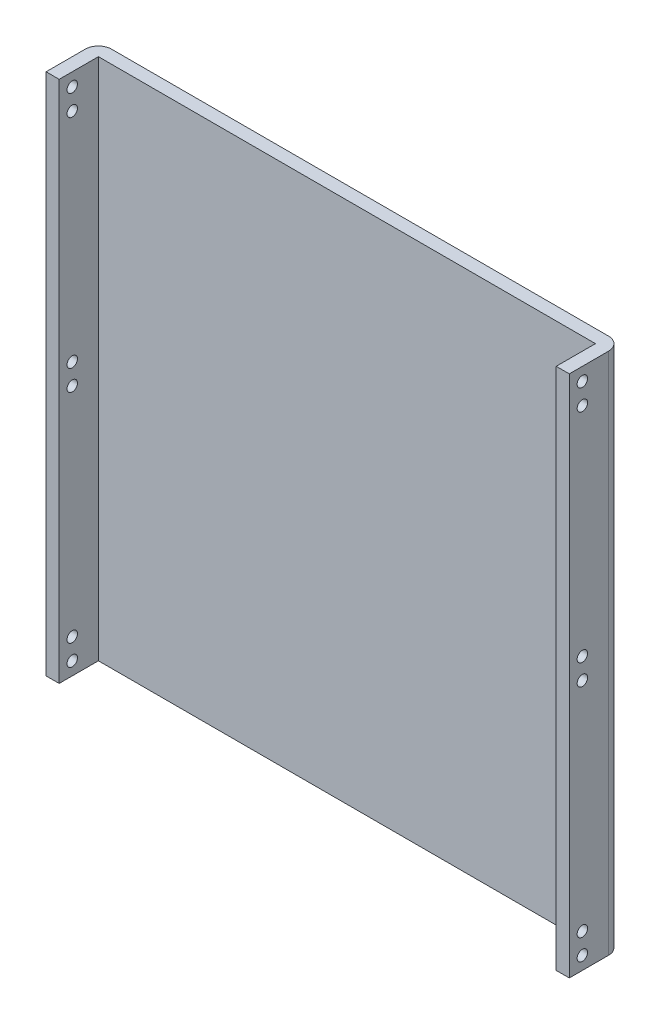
ISO-10303-21;
HEADER;
FILE_DESCRIPTION(('STEP AP214'),'2;1');
FILE_NAME('part.step','',(''),(''),'','','');
FILE_SCHEMA(('AUTOMOTIVE_DESIGN { 1 0 10303 214 1 1 1 1 }'));
ENDSEC;
DATA;
#1=APPLICATION_CONTEXT('core data for automotive mechanical design processes');
#2=APPLICATION_PROTOCOL_DEFINITION('international standard','automotive_design',2000,#1);
#3=PRODUCT_CONTEXT('',#1,'mechanical');
#4=PRODUCT('Part','Part','',(#3));
#5=PRODUCT_RELATED_PRODUCT_CATEGORY('part','',(#4));
#6=PRODUCT_DEFINITION_FORMATION('','',#4);
#7=PRODUCT_DEFINITION_CONTEXT('part definition',#1,'design');
#8=PRODUCT_DEFINITION('design','',#6,#7);
#9=PRODUCT_DEFINITION_SHAPE('','',#8);
#10=(LENGTH_UNIT() NAMED_UNIT(*) SI_UNIT(.MILLI.,.METRE.));
#11=(NAMED_UNIT(*) PLANE_ANGLE_UNIT() SI_UNIT($,.RADIAN.));
#12=(NAMED_UNIT(*) SI_UNIT($,.STERADIAN.) SOLID_ANGLE_UNIT());
#13=UNCERTAINTY_MEASURE_WITH_UNIT(LENGTH_MEASURE(1.E-05),#10,'distance_accuracy_value','');
#14=(GEOMETRIC_REPRESENTATION_CONTEXT(3) GLOBAL_UNCERTAINTY_ASSIGNED_CONTEXT((#13)) GLOBAL_UNIT_ASSIGNED_CONTEXT((#10,
#11,#12)) REPRESENTATION_CONTEXT('',''));
#15=CARTESIAN_POINT('',(0.,0.,0.));
#16=DIRECTION('',(0.,0.,1.));
#17=DIRECTION('',(1.,0.,0.));
#18=AXIS2_PLACEMENT_3D('',#15,#16,#17);
#19=CARTESIAN_POINT('',(-95.,100.,5.));
#20=DIRECTION('',(0.,-1.,0.));
#21=DIRECTION('',(0.,0.,-1.));
#22=AXIS2_PLACEMENT_3D('',#19,#20,#21);
#23=CYLINDRICAL_SURFACE('',#22,5.);
#24=CARTESIAN_POINT('',(-95.,-100.,5.));
#25=DIRECTION('',(0.,1.,0.));
#26=DIRECTION('',(0.,0.,1.));
#27=AXIS2_PLACEMENT_3D('',#24,#25,#26);
#28=CIRCLE('',#27,5.);
#29=CARTESIAN_POINT('',(-95.,-100.,0.));
#30=VERTEX_POINT('',#29);
#31=CARTESIAN_POINT('',(-100.,-100.,5.00000000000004));
#32=VERTEX_POINT('',#31);
#33=EDGE_CURVE('E147',#30,#32,#28,.T.);
#34=ORIENTED_EDGE('',*,*,#33,.T.);
#35=DIRECTION('',(0.,-1.,0.));
#36=VECTOR('',#35,1.);
#37=CARTESIAN_POINT('',(-100.,100.,5.00000000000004));
#38=LINE('',#37,#36);
#39=CARTESIAN_POINT('',(-100.,100.,5.00000000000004));
#40=VERTEX_POINT('',#39);
#41=EDGE_CURVE('E11',#40,#32,#38,.T.);
#42=ORIENTED_EDGE('',*,*,#41,.F.);
#43=CARTESIAN_POINT('',(-95.,100.,5.));
#44=DIRECTION('',(0.,1.,0.));
#45=DIRECTION('',(0.,0.,1.));
#46=AXIS2_PLACEMENT_3D('',#43,#44,#45);
#47=CIRCLE('',#46,5.);
#48=CARTESIAN_POINT('',(-95.,100.,0.));
#49=VERTEX_POINT('',#48);
#50=EDGE_CURVE('E166',#49,#40,#47,.T.);
#51=ORIENTED_EDGE('',*,*,#50,.F.);
#52=DIRECTION('',(0.,-1.,0.));
#53=VECTOR('',#52,1.);
#54=CARTESIAN_POINT('',(-95.,100.,0.));
#55=LINE('',#54,#53);
#56=EDGE_CURVE('E143',#49,#30,#55,.T.);
#57=ORIENTED_EDGE('',*,*,#56,.T.);
#58=EDGE_LOOP('',(#34,#42,#51,#57));
#59=FACE_BOUND('',#58,.T.);
#60=ADVANCED_FACE('F37',(#59),#23,.T.);
#61=CARTESIAN_POINT('',(-100.,100.,5.00000000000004));
#62=DIRECTION('',(1.,0.,0.));
#63=DIRECTION('',(0.,0.,-1.));
#64=AXIS2_PLACEMENT_3D('',#61,#62,#63);
#65=PLANE('',#64);
#66=CARTESIAN_POINT('',(-100.,95.,15.));
#67=DIRECTION('',(-1.,0.,0.));
#68=DIRECTION('',(0.,0.,1.));
#69=AXIS2_PLACEMENT_3D('',#66,#67,#68);
#70=CIRCLE('',#69,2.00000000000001);
#71=CARTESIAN_POINT('',(-100.,95.,17.));
#72=VERTEX_POINT('',#71);
#73=EDGE_CURVE('E188',#72,#72,#70,.T.);
#74=ORIENTED_EDGE('',*,*,#73,.F.);
#75=EDGE_LOOP('',(#74));
#76=FACE_BOUND('',#75,.T.);
#77=CARTESIAN_POINT('',(-100.,-87.,15.));
#78=DIRECTION('',(-1.,0.,0.));
#79=DIRECTION('',(0.,0.,-1.));
#80=AXIS2_PLACEMENT_3D('',#77,#78,#79);
#81=CIRCLE('',#80,2.);
#82=CARTESIAN_POINT('',(-100.,-87.,17.));
#83=VERTEX_POINT('',#82);
#84=EDGE_CURVE('E532',#83,#83,#81,.T.);
#85=ORIENTED_EDGE('',*,*,#84,.F.);
#86=EDGE_LOOP('',(#85));
#87=FACE_BOUND('',#86,.T.);
#88=CARTESIAN_POINT('',(-100.,-95.,15.));
#89=DIRECTION('',(-1.,0.,0.));
#90=DIRECTION('',(0.,0.,-1.));
#91=AXIS2_PLACEMENT_3D('',#88,#89,#90);
#92=CIRCLE('',#91,2.00000000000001);
#93=CARTESIAN_POINT('',(-100.,-95.,17.));
#94=VERTEX_POINT('',#93);
#95=EDGE_CURVE('E319',#94,#94,#92,.T.);
#96=ORIENTED_EDGE('',*,*,#95,.F.);
#97=EDGE_LOOP('',(#96));
#98=FACE_BOUND('',#97,.T.);
#99=CARTESIAN_POINT('',(-100.,-4.,15.));
#100=DIRECTION('',(-1.,0.,0.));
#101=DIRECTION('',(0.,0.,-1.));
#102=AXIS2_PLACEMENT_3D('',#99,#100,#101);
#103=CIRCLE('',#102,1.99999999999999);
#104=CARTESIAN_POINT('',(-100.,-4.,17.));
#105=VERTEX_POINT('',#104);
#106=EDGE_CURVE('E536',#105,#105,#103,.T.);
#107=ORIENTED_EDGE('',*,*,#106,.F.);
#108=EDGE_LOOP('',(#107));
#109=FACE_BOUND('',#108,.T.);
#110=CARTESIAN_POINT('',(-100.,4.,15.));
#111=DIRECTION('',(-1.,0.,0.));
#112=DIRECTION('',(0.,0.,1.));
#113=AXIS2_PLACEMENT_3D('',#110,#111,#112);
#114=CIRCLE('',#113,2.);
#115=CARTESIAN_POINT('',(-100.,4.,17.));
#116=VERTEX_POINT('',#115);
#117=EDGE_CURVE('E529',#116,#116,#114,.T.);
#118=ORIENTED_EDGE('',*,*,#117,.F.);
#119=EDGE_LOOP('',(#118));
#120=FACE_BOUND('',#119,.T.);
#121=CARTESIAN_POINT('',(-100.,87.,15.));
#122=DIRECTION('',(-1.,0.,0.));
#123=DIRECTION('',(0.,0.,1.));
#124=AXIS2_PLACEMENT_3D('',#121,#122,#123);
#125=CIRCLE('',#124,2.00000000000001);
#126=CARTESIAN_POINT('',(-100.,87.,17.));
#127=VERTEX_POINT('',#126);
#128=EDGE_CURVE('E526',#127,#127,#125,.T.);
#129=ORIENTED_EDGE('',*,*,#128,.F.);
#130=EDGE_LOOP('',(#129));
#131=FACE_BOUND('',#130,.T.);
#132=DIRECTION('',(0.,0.,1.));
#133=VECTOR('',#132,1.);
#134=CARTESIAN_POINT('',(-100.,-100.,5.00000000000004));
#135=LINE('',#134,#133);
#136=CARTESIAN_POINT('',(-100.,-100.,20.));
#137=VERTEX_POINT('',#136);
#138=EDGE_CURVE('E150',#32,#137,#135,.T.);
#139=ORIENTED_EDGE('',*,*,#138,.T.);
#140=DIRECTION('',(0.,-1.,0.));
#141=VECTOR('',#140,1.);
#142=CARTESIAN_POINT('',(-100.,100.,20.));
#143=LINE('',#142,#141);
#144=CARTESIAN_POINT('',(-100.,100.,20.));
#145=VERTEX_POINT('',#144);
#146=EDGE_CURVE('E46',#145,#137,#143,.T.);
#147=ORIENTED_EDGE('',*,*,#146,.F.);
#148=DIRECTION('',(0.,0.,1.));
#149=VECTOR('',#148,1.);
#150=CARTESIAN_POINT('',(-100.,100.,5.00000000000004));
#151=LINE('',#150,#149);
#152=EDGE_CURVE('E104',#40,#145,#151,.T.);
#153=ORIENTED_EDGE('',*,*,#152,.F.);
#154=ORIENTED_EDGE('',*,*,#41,.T.);
#155=EDGE_LOOP('',(#139,#147,#153,#154));
#156=FACE_BOUND('',#155,.T.);
#157=ADVANCED_FACE('F264',(#76,#87,#98,#109,#120,#131,#156),#65,.F.);
#158=CARTESIAN_POINT('',(-100.,100.,20.));
#159=DIRECTION('',(0.,0.,-1.));
#160=DIRECTION('',(-1.,0.,0.));
#161=AXIS2_PLACEMENT_3D('',#158,#159,#160);
#162=PLANE('',#161);
#163=DIRECTION('',(1.,0.,0.));
#164=VECTOR('',#163,1.);
#165=CARTESIAN_POINT('',(-100.,-100.,20.));
#166=LINE('',#165,#164);
#167=CARTESIAN_POINT('',(-95.,-100.,20.));
#168=VERTEX_POINT('',#167);
#169=EDGE_CURVE('E153',#137,#168,#166,.T.);
#170=ORIENTED_EDGE('',*,*,#169,.T.);
#171=DIRECTION('',(0.,-1.,0.));
#172=VECTOR('',#171,1.);
#173=CARTESIAN_POINT('',(-95.,100.,20.));
#174=LINE('',#173,#172);
#175=CARTESIAN_POINT('',(-95.,100.,20.));
#176=VERTEX_POINT('',#175);
#177=EDGE_CURVE('E179',#176,#168,#174,.T.);
#178=ORIENTED_EDGE('',*,*,#177,.F.);
#179=DIRECTION('',(1.,0.,0.));
#180=VECTOR('',#179,1.);
#181=CARTESIAN_POINT('',(-100.,100.,20.));
#182=LINE('',#181,#180);
#183=EDGE_CURVE('E229',#145,#176,#182,.T.);
#184=ORIENTED_EDGE('',*,*,#183,.F.);
#185=ORIENTED_EDGE('',*,*,#146,.T.);
#186=EDGE_LOOP('',(#170,#178,#184,#185));
#187=FACE_BOUND('',#186,.T.);
#188=ADVANCED_FACE('F268',(#187),#162,.F.);
#189=CARTESIAN_POINT('',(-95.,100.,5.));
#190=DIRECTION('',(-1.,0.,0.));
#191=DIRECTION('',(0.,0.,1.));
#192=AXIS2_PLACEMENT_3D('',#189,#190,#191);
#193=PLANE('',#192);
#194=CARTESIAN_POINT('',(-95.,95.,15.));
#195=DIRECTION('',(-1.,0.,0.));
#196=DIRECTION('',(0.,0.,1.));
#197=AXIS2_PLACEMENT_3D('',#194,#195,#196);
#198=CIRCLE('',#197,2.00000000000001);
#199=CARTESIAN_POINT('',(-95.,95.,17.));
#200=VERTEX_POINT('',#199);
#201=EDGE_CURVE('E151',#200,#200,#198,.T.);
#202=ORIENTED_EDGE('',*,*,#201,.T.);
#203=EDGE_LOOP('',(#202));
#204=FACE_BOUND('',#203,.T.);
#205=CARTESIAN_POINT('',(-95.,-87.,15.));
#206=DIRECTION('',(-1.,0.,0.));
#207=DIRECTION('',(0.,0.,1.));
#208=AXIS2_PLACEMENT_3D('',#205,#206,#207);
#209=CIRCLE('',#208,2.);
#210=CARTESIAN_POINT('',(-95.,-87.,17.));
#211=VERTEX_POINT('',#210);
#212=EDGE_CURVE('E210',#211,#211,#209,.T.);
#213=ORIENTED_EDGE('',*,*,#212,.T.);
#214=EDGE_LOOP('',(#213));
#215=FACE_BOUND('',#214,.T.);
#216=CARTESIAN_POINT('',(-95.,-95.,15.));
#217=DIRECTION('',(-1.,0.,0.));
#218=DIRECTION('',(0.,0.,1.));
#219=AXIS2_PLACEMENT_3D('',#216,#217,#218);
#220=CIRCLE('',#219,2.00000000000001);
#221=CARTESIAN_POINT('',(-95.,-95.,17.));
#222=VERTEX_POINT('',#221);
#223=EDGE_CURVE('E206',#222,#222,#220,.T.);
#224=ORIENTED_EDGE('',*,*,#223,.T.);
#225=EDGE_LOOP('',(#224));
#226=FACE_BOUND('',#225,.T.);
#227=CARTESIAN_POINT('',(-95.,-4.,15.));
#228=DIRECTION('',(-1.,0.,0.));
#229=DIRECTION('',(0.,0.,1.));
#230=AXIS2_PLACEMENT_3D('',#227,#228,#229);
#231=CIRCLE('',#230,1.99999999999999);
#232=CARTESIAN_POINT('',(-95.,-4.,17.));
#233=VERTEX_POINT('',#232);
#234=EDGE_CURVE('E202',#233,#233,#231,.T.);
#235=ORIENTED_EDGE('',*,*,#234,.T.);
#236=EDGE_LOOP('',(#235));
#237=FACE_BOUND('',#236,.T.);
#238=CARTESIAN_POINT('',(-95.,4.,15.));
#239=DIRECTION('',(-1.,0.,0.));
#240=DIRECTION('',(0.,0.,1.));
#241=AXIS2_PLACEMENT_3D('',#238,#239,#240);
#242=CIRCLE('',#241,2.);
#243=CARTESIAN_POINT('',(-95.,4.,17.));
#244=VERTEX_POINT('',#243);
#245=EDGE_CURVE('E198',#244,#244,#242,.T.);
#246=ORIENTED_EDGE('',*,*,#245,.T.);
#247=EDGE_LOOP('',(#246));
#248=FACE_BOUND('',#247,.T.);
#249=CARTESIAN_POINT('',(-95.,87.,15.));
#250=DIRECTION('',(-1.,0.,0.));
#251=DIRECTION('',(0.,0.,1.));
#252=AXIS2_PLACEMENT_3D('',#249,#250,#251);
#253=CIRCLE('',#252,2.00000000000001);
#254=CARTESIAN_POINT('',(-95.,87.,17.));
#255=VERTEX_POINT('',#254);
#256=EDGE_CURVE('E193',#255,#255,#253,.T.);
#257=ORIENTED_EDGE('',*,*,#256,.T.);
#258=EDGE_LOOP('',(#257));
#259=FACE_BOUND('',#258,.T.);
#260=DIRECTION('',(0.,0.,-1.));
#261=VECTOR('',#260,1.);
#262=CARTESIAN_POINT('',(-95.,-100.,5.));
#263=LINE('',#262,#261);
#264=CARTESIAN_POINT('',(-95.,-100.,5.));
#265=VERTEX_POINT('',#264);
#266=EDGE_CURVE('E155',#168,#265,#263,.T.);
#267=ORIENTED_EDGE('',*,*,#266,.T.);
#268=DIRECTION('',(0.,-1.,0.));
#269=VECTOR('',#268,1.);
#270=CARTESIAN_POINT('',(-95.,100.,5.));
#271=LINE('',#270,#269);
#272=CARTESIAN_POINT('',(-95.,100.,5.));
#273=VERTEX_POINT('',#272);
#274=EDGE_CURVE('E176',#273,#265,#271,.T.);
#275=ORIENTED_EDGE('',*,*,#274,.F.);
#276=DIRECTION('',(0.,0.,-1.));
#277=VECTOR('',#276,1.);
#278=CARTESIAN_POINT('',(-95.,100.,5.));
#279=LINE('',#278,#277);
#280=EDGE_CURVE('E231',#176,#273,#279,.T.);
#281=ORIENTED_EDGE('',*,*,#280,.F.);
#282=ORIENTED_EDGE('',*,*,#177,.T.);
#283=EDGE_LOOP('',(#267,#275,#281,#282));
#284=FACE_BOUND('',#283,.T.);
#285=ADVANCED_FACE('F273',(#204,#215,#226,#237,#248,#259,#284),#193,.F.);
#286=CARTESIAN_POINT('',(95.,100.,5.00000000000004));
#287=DIRECTION('',(0.,0.,-1.));
#288=DIRECTION('',(-1.,0.,0.));
#289=AXIS2_PLACEMENT_3D('',#286,#287,#288);
#290=PLANE('',#289);
#291=DIRECTION('',(1.,0.,0.));
#292=VECTOR('',#291,1.);
#293=CARTESIAN_POINT('',(95.,-100.,5.00000000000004));
#294=LINE('',#293,#292);
#295=CARTESIAN_POINT('',(95.,-100.,5.00000000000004));
#296=VERTEX_POINT('',#295);
#297=EDGE_CURVE('E157',#265,#296,#294,.T.);
#298=ORIENTED_EDGE('',*,*,#297,.T.);
#299=DIRECTION('',(0.,-1.,0.));
#300=VECTOR('',#299,1.);
#301=CARTESIAN_POINT('',(95.,100.,5.00000000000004));
#302=LINE('',#301,#300);
#303=CARTESIAN_POINT('',(95.,100.,5.00000000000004));
#304=VERTEX_POINT('',#303);
#305=EDGE_CURVE('E173',#304,#296,#302,.T.);
#306=ORIENTED_EDGE('',*,*,#305,.F.);
#307=DIRECTION('',(1.,0.,0.));
#308=VECTOR('',#307,1.);
#309=CARTESIAN_POINT('',(95.,100.,5.00000000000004));
#310=LINE('',#309,#308);
#311=EDGE_CURVE('E233',#273,#304,#310,.T.);
#312=ORIENTED_EDGE('',*,*,#311,.F.);
#313=ORIENTED_EDGE('',*,*,#274,.T.);
#314=EDGE_LOOP('',(#298,#306,#312,#313));
#315=FACE_BOUND('',#314,.T.);
#316=ADVANCED_FACE('F281',(#315),#290,.F.);
#317=CARTESIAN_POINT('',(95.,100.,5.00000000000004));
#318=DIRECTION('',(1.,0.,0.));
#319=DIRECTION('',(0.,0.,-1.));
#320=AXIS2_PLACEMENT_3D('',#317,#318,#319);
#321=PLANE('',#320);
#322=CARTESIAN_POINT('',(95.,95.,15.));
#323=DIRECTION('',(1.,0.,0.));
#324=DIRECTION('',(0.,0.,-1.));
#325=AXIS2_PLACEMENT_3D('',#322,#323,#324);
#326=CIRCLE('',#325,2.00000000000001);
#327=CARTESIAN_POINT('',(95.,95.,17.));
#328=VERTEX_POINT('',#327);
#329=EDGE_CURVE('E222',#328,#328,#326,.T.);
#330=ORIENTED_EDGE('',*,*,#329,.T.);
#331=EDGE_LOOP('',(#330));
#332=FACE_BOUND('',#331,.T.);
#333=CARTESIAN_POINT('',(95.,-87.,15.));
#334=DIRECTION('',(1.,0.,0.));
#335=DIRECTION('',(0.,0.,-1.));
#336=AXIS2_PLACEMENT_3D('',#333,#334,#335);
#337=CIRCLE('',#336,2.);
#338=CARTESIAN_POINT('',(95.,-87.,17.));
#339=VERTEX_POINT('',#338);
#340=EDGE_CURVE('E205',#339,#339,#337,.T.);
#341=ORIENTED_EDGE('',*,*,#340,.T.);
#342=EDGE_LOOP('',(#341));
#343=FACE_BOUND('',#342,.T.);
#344=CARTESIAN_POINT('',(95.,-95.,15.));
#345=DIRECTION('',(1.,0.,0.));
#346=DIRECTION('',(0.,0.,-1.));
#347=AXIS2_PLACEMENT_3D('',#344,#345,#346);
#348=CIRCLE('',#347,2.00000000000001);
#349=CARTESIAN_POINT('',(95.,-95.,17.));
#350=VERTEX_POINT('',#349);
#351=EDGE_CURVE('E201',#350,#350,#348,.T.);
#352=ORIENTED_EDGE('',*,*,#351,.T.);
#353=EDGE_LOOP('',(#352));
#354=FACE_BOUND('',#353,.T.);
#355=CARTESIAN_POINT('',(95.,-4.,15.));
#356=DIRECTION('',(1.,0.,0.));
#357=DIRECTION('',(0.,0.,-1.));
#358=AXIS2_PLACEMENT_3D('',#355,#356,#357);
#359=CIRCLE('',#358,1.99999999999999);
#360=CARTESIAN_POINT('',(95.,-4.,17.));
#361=VERTEX_POINT('',#360);
#362=EDGE_CURVE('E197',#361,#361,#359,.T.);
#363=ORIENTED_EDGE('',*,*,#362,.T.);
#364=EDGE_LOOP('',(#363));
#365=FACE_BOUND('',#364,.T.);
#366=CARTESIAN_POINT('',(95.,4.,15.));
#367=DIRECTION('',(1.,0.,0.));
#368=DIRECTION('',(0.,0.,-1.));
#369=AXIS2_PLACEMENT_3D('',#366,#367,#368);
#370=CIRCLE('',#369,2.);
#371=CARTESIAN_POINT('',(95.,4.,17.));
#372=VERTEX_POINT('',#371);
#373=EDGE_CURVE('E192',#372,#372,#370,.T.);
#374=ORIENTED_EDGE('',*,*,#373,.T.);
#375=EDGE_LOOP('',(#374));
#376=FACE_BOUND('',#375,.T.);
#377=CARTESIAN_POINT('',(95.,87.,15.));
#378=DIRECTION('',(1.,0.,0.));
#379=DIRECTION('',(0.,0.,-1.));
#380=AXIS2_PLACEMENT_3D('',#377,#378,#379);
#381=CIRCLE('',#380,2.00000000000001);
#382=CARTESIAN_POINT('',(95.,87.,17.));
#383=VERTEX_POINT('',#382);
#384=EDGE_CURVE('E187',#383,#383,#381,.T.);
#385=ORIENTED_EDGE('',*,*,#384,.T.);
#386=EDGE_LOOP('',(#385));
#387=FACE_BOUND('',#386,.T.);
#388=DIRECTION('',(0.,0.,1.));
#389=VECTOR('',#388,1.);
#390=CARTESIAN_POINT('',(95.,-100.,5.00000000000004));
#391=LINE('',#390,#389);
#392=CARTESIAN_POINT('',(95.,-100.,20.));
#393=VERTEX_POINT('',#392);
#394=EDGE_CURVE('E159',#296,#393,#391,.T.);
#395=ORIENTED_EDGE('',*,*,#394,.T.);
#396=DIRECTION('',(0.,-1.,0.));
#397=VECTOR('',#396,1.);
#398=CARTESIAN_POINT('',(95.,100.,20.));
#399=LINE('',#398,#397);
#400=CARTESIAN_POINT('',(95.,100.,20.));
#401=VERTEX_POINT('',#400);
#402=EDGE_CURVE('E170',#401,#393,#399,.T.);
#403=ORIENTED_EDGE('',*,*,#402,.F.);
#404=DIRECTION('',(0.,0.,1.));
#405=VECTOR('',#404,1.);
#406=CARTESIAN_POINT('',(95.,100.,5.00000000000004));
#407=LINE('',#406,#405);
#408=EDGE_CURVE('E235',#304,#401,#407,.T.);
#409=ORIENTED_EDGE('',*,*,#408,.F.);
#410=ORIENTED_EDGE('',*,*,#305,.T.);
#411=EDGE_LOOP('',(#395,#403,#409,#410));
#412=FACE_BOUND('',#411,.T.);
#413=ADVANCED_FACE('F241',(#332,#343,#354,#365,#376,#387,#412),#321,.F.);
#414=CARTESIAN_POINT('',(95.,100.,20.));
#415=DIRECTION('',(0.,0.,-1.));
#416=DIRECTION('',(-1.,0.,0.));
#417=AXIS2_PLACEMENT_3D('',#414,#415,#416);
#418=PLANE('',#417);
#419=DIRECTION('',(1.,0.,0.));
#420=VECTOR('',#419,1.);
#421=CARTESIAN_POINT('',(95.,-100.,20.));
#422=LINE('',#421,#420);
#423=CARTESIAN_POINT('',(100.,-100.,20.));
#424=VERTEX_POINT('',#423);
#425=EDGE_CURVE('E161',#393,#424,#422,.T.);
#426=ORIENTED_EDGE('',*,*,#425,.T.);
#427=DIRECTION('',(0.,-1.,0.));
#428=VECTOR('',#427,1.);
#429=CARTESIAN_POINT('',(100.,100.,20.));
#430=LINE('',#429,#428);
#431=CARTESIAN_POINT('',(100.,100.,20.));
#432=VERTEX_POINT('',#431);
#433=EDGE_CURVE('E138',#432,#424,#430,.T.);
#434=ORIENTED_EDGE('',*,*,#433,.F.);
#435=DIRECTION('',(1.,0.,0.));
#436=VECTOR('',#435,1.);
#437=CARTESIAN_POINT('',(95.,100.,20.));
#438=LINE('',#437,#436);
#439=EDGE_CURVE('E129',#401,#432,#438,.T.);
#440=ORIENTED_EDGE('',*,*,#439,.F.);
#441=ORIENTED_EDGE('',*,*,#402,.T.);
#442=EDGE_LOOP('',(#426,#434,#440,#441));
#443=FACE_BOUND('',#442,.T.);
#444=ADVANCED_FACE('F245',(#443),#418,.F.);
#445=CARTESIAN_POINT('',(100.,100.,5.00000000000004));
#446=DIRECTION('',(-1.,0.,0.));
#447=DIRECTION('',(0.,0.,1.));
#448=AXIS2_PLACEMENT_3D('',#445,#446,#447);
#449=PLANE('',#448);
#450=CARTESIAN_POINT('',(100.,95.,15.));
#451=DIRECTION('',(-1.,0.,0.));
#452=DIRECTION('',(0.,0.,1.));
#453=AXIS2_PLACEMENT_3D('',#450,#451,#452);
#454=CIRCLE('',#453,2.00000000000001);
#455=CARTESIAN_POINT('',(100.,95.,17.));
#456=VERTEX_POINT('',#455);
#457=EDGE_CURVE('E40',#456,#456,#454,.T.);
#458=ORIENTED_EDGE('',*,*,#457,.T.);
#459=EDGE_LOOP('',(#458));
#460=FACE_BOUND('',#459,.T.);
#461=CARTESIAN_POINT('',(100.,-87.,15.));
#462=DIRECTION('',(-1.,0.,0.));
#463=DIRECTION('',(0.,0.,1.));
#464=AXIS2_PLACEMENT_3D('',#461,#462,#463);
#465=CIRCLE('',#464,2.);
#466=CARTESIAN_POINT('',(100.,-87.,17.));
#467=VERTEX_POINT('',#466);
#468=EDGE_CURVE('E203',#467,#467,#465,.T.);
#469=ORIENTED_EDGE('',*,*,#468,.T.);
#470=EDGE_LOOP('',(#469));
#471=FACE_BOUND('',#470,.T.);
#472=CARTESIAN_POINT('',(100.,-95.,15.));
#473=DIRECTION('',(-1.,0.,0.));
#474=DIRECTION('',(0.,0.,1.));
#475=AXIS2_PLACEMENT_3D('',#472,#473,#474);
#476=CIRCLE('',#475,2.00000000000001);
#477=CARTESIAN_POINT('',(100.,-95.,17.));
#478=VERTEX_POINT('',#477);
#479=EDGE_CURVE('E199',#478,#478,#476,.T.);
#480=ORIENTED_EDGE('',*,*,#479,.T.);
#481=EDGE_LOOP('',(#480));
#482=FACE_BOUND('',#481,.T.);
#483=CARTESIAN_POINT('',(100.,-4.,15.));
#484=DIRECTION('',(-1.,0.,0.));
#485=DIRECTION('',(0.,0.,1.));
#486=AXIS2_PLACEMENT_3D('',#483,#484,#485);
#487=CIRCLE('',#486,1.99999999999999);
#488=CARTESIAN_POINT('',(100.,-4.,17.));
#489=VERTEX_POINT('',#488);
#490=EDGE_CURVE('E194',#489,#489,#487,.T.);
#491=ORIENTED_EDGE('',*,*,#490,.T.);
#492=EDGE_LOOP('',(#491));
#493=FACE_BOUND('',#492,.T.);
#494=CARTESIAN_POINT('',(100.,4.,15.));
#495=DIRECTION('',(-1.,0.,0.));
#496=DIRECTION('',(0.,0.,1.));
#497=AXIS2_PLACEMENT_3D('',#494,#495,#496);
#498=CIRCLE('',#497,2.);
#499=CARTESIAN_POINT('',(100.,4.,17.));
#500=VERTEX_POINT('',#499);
#501=EDGE_CURVE('E189',#500,#500,#498,.T.);
#502=ORIENTED_EDGE('',*,*,#501,.T.);
#503=EDGE_LOOP('',(#502));
#504=FACE_BOUND('',#503,.T.);
#505=CARTESIAN_POINT('',(100.,87.,15.));
#506=DIRECTION('',(-1.,0.,0.));
#507=DIRECTION('',(0.,0.,1.));
#508=AXIS2_PLACEMENT_3D('',#505,#506,#507);
#509=CIRCLE('',#508,2.00000000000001);
#510=CARTESIAN_POINT('',(100.,87.,17.));
#511=VERTEX_POINT('',#510);
#512=EDGE_CURVE('E184',#511,#511,#509,.T.);
#513=ORIENTED_EDGE('',*,*,#512,.T.);
#514=EDGE_LOOP('',(#513));
#515=FACE_BOUND('',#514,.T.);
#516=DIRECTION('',(0.,0.,-1.));
#517=VECTOR('',#516,1.);
#518=CARTESIAN_POINT('',(100.,-100.,5.00000000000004));
#519=LINE('',#518,#517);
#520=CARTESIAN_POINT('',(100.,-100.,5.00000000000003));
#521=VERTEX_POINT('',#520);
#522=EDGE_CURVE('E137',#424,#521,#519,.T.);
#523=ORIENTED_EDGE('',*,*,#522,.T.);
#524=DIRECTION('',(0.,-1.,0.));
#525=VECTOR('',#524,1.);
#526=CARTESIAN_POINT('',(100.,100.,5.00000000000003));
#527=LINE('',#526,#525);
#528=CARTESIAN_POINT('',(100.,100.,5.00000000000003));
#529=VERTEX_POINT('',#528);
#530=EDGE_CURVE('E134',#529,#521,#527,.T.);
#531=ORIENTED_EDGE('',*,*,#530,.F.);
#532=DIRECTION('',(0.,0.,-1.));
#533=VECTOR('',#532,1.);
#534=CARTESIAN_POINT('',(100.,100.,5.00000000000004));
#535=LINE('',#534,#533);
#536=EDGE_CURVE('E123',#432,#529,#535,.T.);
#537=ORIENTED_EDGE('',*,*,#536,.F.);
#538=ORIENTED_EDGE('',*,*,#433,.T.);
#539=EDGE_LOOP('',(#523,#531,#537,#538));
#540=FACE_BOUND('',#539,.T.);
#541=ADVANCED_FACE('F135',(#460,#471,#482,#493,#504,#515,#540),#449,.F.);
#542=CARTESIAN_POINT('',(95.,100.,5.));
#543=DIRECTION('',(0.,-1.,0.));
#544=DIRECTION('',(0.,0.,-1.));
#545=AXIS2_PLACEMENT_3D('',#542,#543,#544);
#546=CYLINDRICAL_SURFACE('',#545,5.);
#547=CARTESIAN_POINT('',(95.,-100.,5.));
#548=DIRECTION('',(0.,1.,0.));
#549=DIRECTION('',(0.,0.,-1.));
#550=AXIS2_PLACEMENT_3D('',#547,#548,#549);
#551=CIRCLE('',#550,5.);
#552=CARTESIAN_POINT('',(95.,-100.,0.));
#553=VERTEX_POINT('',#552);
#554=EDGE_CURVE('E90',#521,#553,#551,.T.);
#555=ORIENTED_EDGE('',*,*,#554,.T.);
#556=DIRECTION('',(0.,-1.,0.));
#557=VECTOR('',#556,1.);
#558=CARTESIAN_POINT('',(95.,100.,0.));
#559=LINE('',#558,#557);
#560=CARTESIAN_POINT('',(95.,100.,0.));
#561=VERTEX_POINT('',#560);
#562=EDGE_CURVE('E139',#561,#553,#559,.T.);
#563=ORIENTED_EDGE('',*,*,#562,.F.);
#564=CARTESIAN_POINT('',(95.,100.,5.));
#565=DIRECTION('',(0.,1.,0.));
#566=DIRECTION('',(0.,0.,-1.));
#567=AXIS2_PLACEMENT_3D('',#564,#565,#566);
#568=CIRCLE('',#567,5.);
#569=EDGE_CURVE('E127',#529,#561,#568,.T.);
#570=ORIENTED_EDGE('',*,*,#569,.F.);
#571=ORIENTED_EDGE('',*,*,#530,.T.);
#572=EDGE_LOOP('',(#555,#563,#570,#571));
#573=FACE_BOUND('',#572,.T.);
#574=ADVANCED_FACE('F141',(#573),#546,.T.);
#575=CARTESIAN_POINT('',(95.,100.,0.));
#576=DIRECTION('',(0.,0.,1.));
#577=DIRECTION('',(1.,0.,0.));
#578=AXIS2_PLACEMENT_3D('',#575,#576,#577);
#579=PLANE('',#578);
#580=DIRECTION('',(-1.,0.,0.));
#581=VECTOR('',#580,1.);
#582=CARTESIAN_POINT('',(95.,-100.,0.));
#583=LINE('',#582,#581);
#584=EDGE_CURVE('E96',#553,#30,#583,.T.);
#585=ORIENTED_EDGE('',*,*,#584,.T.);
#586=ORIENTED_EDGE('',*,*,#56,.F.);
#587=DIRECTION('',(-1.,0.,0.));
#588=VECTOR('',#587,1.);
#589=CARTESIAN_POINT('',(95.,100.,0.));
#590=LINE('',#589,#588);
#591=EDGE_CURVE('E55',#561,#49,#590,.T.);
#592=ORIENTED_EDGE('',*,*,#591,.F.);
#593=ORIENTED_EDGE('',*,*,#562,.T.);
#594=EDGE_LOOP('',(#585,#586,#592,#593));
#595=FACE_BOUND('',#594,.T.);
#596=ADVANCED_FACE('F253',(#595),#579,.F.);
#597=CARTESIAN_POINT('',(-95.,100.,5.));
#598=DIRECTION('',(0.,1.,0.));
#599=DIRECTION('',(0.,0.,1.));
#600=AXIS2_PLACEMENT_3D('',#597,#598,#599);
#601=PLANE('',#600);
#602=ORIENTED_EDGE('',*,*,#50,.T.);
#603=ORIENTED_EDGE('',*,*,#152,.T.);
#604=ORIENTED_EDGE('',*,*,#183,.T.);
#605=ORIENTED_EDGE('',*,*,#280,.T.);
#606=ORIENTED_EDGE('',*,*,#311,.T.);
#607=ORIENTED_EDGE('',*,*,#408,.T.);
#608=ORIENTED_EDGE('',*,*,#439,.T.);
#609=ORIENTED_EDGE('',*,*,#536,.T.);
#610=ORIENTED_EDGE('',*,*,#569,.T.);
#611=ORIENTED_EDGE('',*,*,#591,.T.);
#612=EDGE_LOOP('',(#602,#603,#604,#605,#606,#607,#608,#609,#610,#611));
#613=FACE_BOUND('',#612,.T.);
#614=ADVANCED_FACE('F125',(#613),#601,.T.);
#615=CARTESIAN_POINT('',(-95.,-100.,5.));
#616=DIRECTION('',(0.,1.,0.));
#617=DIRECTION('',(0.,0.,1.));
#618=AXIS2_PLACEMENT_3D('',#615,#616,#617);
#619=PLANE('',#618);
#620=ORIENTED_EDGE('',*,*,#33,.F.);
#621=ORIENTED_EDGE('',*,*,#584,.F.);
#622=ORIENTED_EDGE('',*,*,#554,.F.);
#623=ORIENTED_EDGE('',*,*,#522,.F.);
#624=ORIENTED_EDGE('',*,*,#425,.F.);
#625=ORIENTED_EDGE('',*,*,#394,.F.);
#626=ORIENTED_EDGE('',*,*,#297,.F.);
#627=ORIENTED_EDGE('',*,*,#266,.F.);
#628=ORIENTED_EDGE('',*,*,#169,.F.);
#629=ORIENTED_EDGE('',*,*,#138,.F.);
#630=EDGE_LOOP('',(#620,#621,#622,#623,#624,#625,#626,#627,#628,#629));
#631=FACE_BOUND('',#630,.T.);
#632=ADVANCED_FACE('F248',(#631),#619,.F.);
#633=CARTESIAN_POINT('',(114.,87.,15.));
#634=DIRECTION('',(-1.,0.,0.));
#635=DIRECTION('',(0.,0.,1.));
#636=AXIS2_PLACEMENT_3D('',#633,#634,#635);
#637=CYLINDRICAL_SURFACE('',#636,2.00000000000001);
#638=CARTESIAN_POINT('',(100.,87.,17.));
#639=CARTESIAN_POINT('',(99.9479166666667,87.,17.));
#640=CARTESIAN_POINT('',(99.8958333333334,87.,17.));
#641=CARTESIAN_POINT('',(99.7916666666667,87.,17.));
#642=CARTESIAN_POINT('',(99.7395833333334,87.,17.));
#643=CARTESIAN_POINT('',(99.6354166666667,87.,17.));
#644=CARTESIAN_POINT('',(99.5833333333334,87.,17.));
#645=CARTESIAN_POINT('',(99.4791666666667,87.,17.));
#646=CARTESIAN_POINT('',(99.4270833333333,87.,17.));
#647=CARTESIAN_POINT('',(99.3229166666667,87.,17.));
#648=CARTESIAN_POINT('',(99.2708333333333,87.,17.));
#649=CARTESIAN_POINT('',(99.1666666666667,87.,17.));
#650=CARTESIAN_POINT('',(99.1145833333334,87.,17.));
#651=CARTESIAN_POINT('',(99.0104166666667,87.,17.));
#652=CARTESIAN_POINT('',(98.9583333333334,87.,17.));
#653=CARTESIAN_POINT('',(98.8541666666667,87.,17.));
#654=CARTESIAN_POINT('',(98.8020833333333,87.,17.));
#655=CARTESIAN_POINT('',(98.6979166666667,87.,17.));
#656=CARTESIAN_POINT('',(98.6458333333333,87.,17.));
#657=CARTESIAN_POINT('',(98.5416666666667,87.,17.));
#658=CARTESIAN_POINT('',(98.4895833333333,87.,17.));
#659=CARTESIAN_POINT('',(98.3854166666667,87.,17.));
#660=CARTESIAN_POINT('',(98.3333333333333,87.,17.));
#661=CARTESIAN_POINT('',(98.2291666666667,87.,17.));
#662=CARTESIAN_POINT('',(98.1770833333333,87.,17.));
#663=CARTESIAN_POINT('',(98.0729166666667,87.,17.));
#664=CARTESIAN_POINT('',(98.0208333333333,87.,17.));
#665=CARTESIAN_POINT('',(97.9166666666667,87.,17.));
#666=CARTESIAN_POINT('',(97.8645833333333,87.,17.));
#667=CARTESIAN_POINT('',(97.7604166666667,87.,17.));
#668=CARTESIAN_POINT('',(97.7083333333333,87.,17.));
#669=CARTESIAN_POINT('',(97.6041666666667,87.,17.));
#670=CARTESIAN_POINT('',(97.5520833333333,87.,17.));
#671=CARTESIAN_POINT('',(97.4479166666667,87.,17.));
#672=CARTESIAN_POINT('',(97.3958333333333,87.,17.));
#673=CARTESIAN_POINT('',(97.2916666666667,87.,17.));
#674=CARTESIAN_POINT('',(97.2395833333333,87.,17.));
#675=CARTESIAN_POINT('',(97.1354166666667,87.,17.));
#676=CARTESIAN_POINT('',(97.0833333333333,87.,17.));
#677=CARTESIAN_POINT('',(96.9791666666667,87.,17.));
#678=CARTESIAN_POINT('',(96.9270833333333,87.,17.));
#679=CARTESIAN_POINT('',(96.8229166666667,87.,17.));
#680=CARTESIAN_POINT('',(96.7708333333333,87.,17.));
#681=CARTESIAN_POINT('',(96.6666666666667,87.,17.));
#682=CARTESIAN_POINT('',(96.6145833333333,87.,17.));
#683=CARTESIAN_POINT('',(96.5104166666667,87.,17.));
#684=CARTESIAN_POINT('',(96.4583333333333,87.,17.));
#685=CARTESIAN_POINT('',(96.3541666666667,87.,17.));
#686=CARTESIAN_POINT('',(96.3020833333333,87.,17.));
#687=CARTESIAN_POINT('',(96.1979166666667,87.,17.));
#688=CARTESIAN_POINT('',(96.1458333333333,87.,17.));
#689=CARTESIAN_POINT('',(96.0416666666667,87.,17.));
#690=CARTESIAN_POINT('',(95.9895833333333,87.,17.));
#691=CARTESIAN_POINT('',(95.8854166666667,87.,17.));
#692=CARTESIAN_POINT('',(95.8333333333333,87.,17.));
#693=CARTESIAN_POINT('',(95.7291666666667,87.,17.));
#694=CARTESIAN_POINT('',(95.6770833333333,87.,17.));
#695=CARTESIAN_POINT('',(95.5729166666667,87.,17.));
#696=CARTESIAN_POINT('',(95.5208333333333,87.,17.));
#697=CARTESIAN_POINT('',(95.4166666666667,87.,17.));
#698=CARTESIAN_POINT('',(95.3645833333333,87.,17.));
#699=CARTESIAN_POINT('',(95.2604166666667,87.,17.));
#700=CARTESIAN_POINT('',(95.2083333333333,87.,17.));
#701=CARTESIAN_POINT('',(95.1041666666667,87.,17.));
#702=CARTESIAN_POINT('',(95.0520833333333,87.,17.));
#703=CARTESIAN_POINT('',(95.,87.,17.));
#704=B_SPLINE_CURVE_WITH_KNOTS('',3,(#638,#639,#640,#641,#642,#643,#644,#645,#646,#647,#648,
#649,#650,#651,#652,#653,#654,#655,#656,#657,#658,#659,#660,#661,#662,#663,#664,#665,#666,#667,
#668,#669,#670,#671,#672,#673,#674,#675,#676,#677,#678,#679,#680,#681,#682,#683,#684,#685,#686,
#687,#688,#689,#690,#691,#692,#693,#694,#695,#696,#697,#698,#699,#700,#701,#702,#703),
.UNSPECIFIED.,.F.,.F.,(4,2,2,2,2,2,2,2,2,2,2,2,2,2,2,2,2,2,2,2,2,2,2,2,2,2,2,2,2,2,2,2,4),(0.,
0.156249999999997,0.312499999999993,0.468750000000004,0.625000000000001,0.781249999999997,
0.937499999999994,1.09375,1.25,1.40625000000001,1.56250000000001,1.71875,1.875,2.03125000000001,
2.18750000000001,2.34375000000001,2.50000000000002,2.65625000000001,2.81250000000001,
2.96875000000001,3.12500000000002,3.28125000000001,3.43750000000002,3.59375000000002,
3.75000000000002,3.90625000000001,4.06250000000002,4.21875000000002,4.37500000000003,
4.53125000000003,4.68750000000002,4.84375000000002,5.00000000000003),.UNSPECIFIED.);
#705=EDGE_CURVE('BSEAM306',#511,#383,#704,.T.);
#706=ORIENTED_EDGE('',*,*,#512,.F.);
#707=ORIENTED_EDGE('',*,*,#384,.F.);
#708=ORIENTED_EDGE('',*,*,#705,.T.);
#709=ORIENTED_EDGE('',*,*,#705,.F.);
#710=EDGE_LOOP('',(#706,#708,#707,#709));
#711=FACE_BOUND('',#710,.T.);
#712=ADVANCED_FACE('F306',(#711),#637,.F.);
#713=CARTESIAN_POINT('',(114.,4.,15.));
#714=DIRECTION('',(-1.,0.,0.));
#715=DIRECTION('',(0.,0.,1.));
#716=AXIS2_PLACEMENT_3D('',#713,#714,#715);
#717=CYLINDRICAL_SURFACE('',#716,2.);
#718=CARTESIAN_POINT('',(100.,4.,17.));
#719=CARTESIAN_POINT('',(99.9479166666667,4.,17.));
#720=CARTESIAN_POINT('',(99.8958333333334,4.,17.));
#721=CARTESIAN_POINT('',(99.7916666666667,4.,17.));
#722=CARTESIAN_POINT('',(99.7395833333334,4.,17.));
#723=CARTESIAN_POINT('',(99.6354166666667,4.,17.));
#724=CARTESIAN_POINT('',(99.5833333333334,4.,17.));
#725=CARTESIAN_POINT('',(99.4791666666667,4.,17.));
#726=CARTESIAN_POINT('',(99.4270833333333,4.,17.));
#727=CARTESIAN_POINT('',(99.3229166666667,4.,17.));
#728=CARTESIAN_POINT('',(99.2708333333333,4.,17.));
#729=CARTESIAN_POINT('',(99.1666666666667,4.,17.));
#730=CARTESIAN_POINT('',(99.1145833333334,4.,17.));
#731=CARTESIAN_POINT('',(99.0104166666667,4.,17.));
#732=CARTESIAN_POINT('',(98.9583333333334,4.,17.));
#733=CARTESIAN_POINT('',(98.8541666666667,4.,17.));
#734=CARTESIAN_POINT('',(98.8020833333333,4.,17.));
#735=CARTESIAN_POINT('',(98.6979166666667,4.,17.));
#736=CARTESIAN_POINT('',(98.6458333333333,4.,17.));
#737=CARTESIAN_POINT('',(98.5416666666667,4.,17.));
#738=CARTESIAN_POINT('',(98.4895833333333,4.,17.));
#739=CARTESIAN_POINT('',(98.3854166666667,4.,17.));
#740=CARTESIAN_POINT('',(98.3333333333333,4.,17.));
#741=CARTESIAN_POINT('',(98.2291666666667,4.,17.));
#742=CARTESIAN_POINT('',(98.1770833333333,4.,17.));
#743=CARTESIAN_POINT('',(98.0729166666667,4.,17.));
#744=CARTESIAN_POINT('',(98.0208333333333,4.,17.));
#745=CARTESIAN_POINT('',(97.9166666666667,4.,17.));
#746=CARTESIAN_POINT('',(97.8645833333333,4.,17.));
#747=CARTESIAN_POINT('',(97.7604166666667,4.,17.));
#748=CARTESIAN_POINT('',(97.7083333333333,4.,17.));
#749=CARTESIAN_POINT('',(97.6041666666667,4.,17.));
#750=CARTESIAN_POINT('',(97.5520833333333,4.,17.));
#751=CARTESIAN_POINT('',(97.4479166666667,4.,17.));
#752=CARTESIAN_POINT('',(97.3958333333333,4.,17.));
#753=CARTESIAN_POINT('',(97.2916666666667,4.,17.));
#754=CARTESIAN_POINT('',(97.2395833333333,4.,17.));
#755=CARTESIAN_POINT('',(97.1354166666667,4.,17.));
#756=CARTESIAN_POINT('',(97.0833333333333,4.,17.));
#757=CARTESIAN_POINT('',(96.9791666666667,4.,17.));
#758=CARTESIAN_POINT('',(96.9270833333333,4.,17.));
#759=CARTESIAN_POINT('',(96.8229166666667,4.,17.));
#760=CARTESIAN_POINT('',(96.7708333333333,4.,17.));
#761=CARTESIAN_POINT('',(96.6666666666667,4.,17.));
#762=CARTESIAN_POINT('',(96.6145833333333,4.,17.));
#763=CARTESIAN_POINT('',(96.5104166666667,4.,17.));
#764=CARTESIAN_POINT('',(96.4583333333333,4.,17.));
#765=CARTESIAN_POINT('',(96.3541666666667,4.,17.));
#766=CARTESIAN_POINT('',(96.3020833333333,4.,17.));
#767=CARTESIAN_POINT('',(96.1979166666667,4.,17.));
#768=CARTESIAN_POINT('',(96.1458333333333,4.,17.));
#769=CARTESIAN_POINT('',(96.0416666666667,4.,17.));
#770=CARTESIAN_POINT('',(95.9895833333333,4.,17.));
#771=CARTESIAN_POINT('',(95.8854166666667,4.,17.));
#772=CARTESIAN_POINT('',(95.8333333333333,4.,17.));
#773=CARTESIAN_POINT('',(95.7291666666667,4.,17.));
#774=CARTESIAN_POINT('',(95.6770833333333,4.,17.));
#775=CARTESIAN_POINT('',(95.5729166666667,4.,17.));
#776=CARTESIAN_POINT('',(95.5208333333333,4.,17.));
#777=CARTESIAN_POINT('',(95.4166666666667,4.,17.));
#778=CARTESIAN_POINT('',(95.3645833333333,4.,17.));
#779=CARTESIAN_POINT('',(95.2604166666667,4.,17.));
#780=CARTESIAN_POINT('',(95.2083333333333,4.,17.));
#781=CARTESIAN_POINT('',(95.1041666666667,4.,17.));
#782=CARTESIAN_POINT('',(95.0520833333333,4.,17.));
#783=CARTESIAN_POINT('',(95.,4.,17.));
#784=B_SPLINE_CURVE_WITH_KNOTS('',3,(#718,#719,#720,#721,#722,#723,#724,#725,#726,#727,#728,
#729,#730,#731,#732,#733,#734,#735,#736,#737,#738,#739,#740,#741,#742,#743,#744,#745,#746,#747,
#748,#749,#750,#751,#752,#753,#754,#755,#756,#757,#758,#759,#760,#761,#762,#763,#764,#765,#766,
#767,#768,#769,#770,#771,#772,#773,#774,#775,#776,#777,#778,#779,#780,#781,#782,#783),
.UNSPECIFIED.,.F.,.F.,(4,2,2,2,2,2,2,2,2,2,2,2,2,2,2,2,2,2,2,2,2,2,2,2,2,2,2,2,2,2,2,2,4),(0.,
0.156249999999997,0.312499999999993,0.468750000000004,0.625000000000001,0.781249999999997,
0.937499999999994,1.09375,1.25,1.40625000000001,1.56250000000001,1.71875,1.875,2.03125000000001,
2.18750000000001,2.34375000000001,2.50000000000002,2.65625000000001,2.81250000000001,
2.96875000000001,3.12500000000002,3.28125000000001,3.43750000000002,3.59375000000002,
3.75000000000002,3.90625000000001,4.06250000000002,4.21875000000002,4.37500000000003,
4.53125000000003,4.68750000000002,4.84375000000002,5.00000000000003),.UNSPECIFIED.);
#785=EDGE_CURVE('BSEAM309',#500,#372,#784,.T.);
#786=ORIENTED_EDGE('',*,*,#501,.F.);
#787=ORIENTED_EDGE('',*,*,#373,.F.);
#788=ORIENTED_EDGE('',*,*,#785,.T.);
#789=ORIENTED_EDGE('',*,*,#785,.F.);
#790=EDGE_LOOP('',(#786,#788,#787,#789));
#791=FACE_BOUND('',#790,.T.);
#792=ADVANCED_FACE('F309',(#791),#717,.F.);
#793=CARTESIAN_POINT('',(114.,-4.,15.));
#794=DIRECTION('',(-1.,0.,0.));
#795=DIRECTION('',(0.,0.,1.));
#796=AXIS2_PLACEMENT_3D('',#793,#794,#795);
#797=CYLINDRICAL_SURFACE('',#796,1.99999999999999);
#798=CARTESIAN_POINT('',(100.,-4.,17.));
#799=CARTESIAN_POINT('',(99.9479166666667,-4.,17.));
#800=CARTESIAN_POINT('',(99.8958333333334,-4.,17.));
#801=CARTESIAN_POINT('',(99.7916666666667,-4.,17.));
#802=CARTESIAN_POINT('',(99.7395833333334,-4.,17.));
#803=CARTESIAN_POINT('',(99.6354166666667,-4.,17.));
#804=CARTESIAN_POINT('',(99.5833333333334,-4.,17.));
#805=CARTESIAN_POINT('',(99.4791666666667,-4.,17.));
#806=CARTESIAN_POINT('',(99.4270833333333,-4.,17.));
#807=CARTESIAN_POINT('',(99.3229166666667,-4.,17.));
#808=CARTESIAN_POINT('',(99.2708333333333,-4.,17.));
#809=CARTESIAN_POINT('',(99.1666666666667,-4.,17.));
#810=CARTESIAN_POINT('',(99.1145833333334,-4.,17.));
#811=CARTESIAN_POINT('',(99.0104166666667,-4.,17.));
#812=CARTESIAN_POINT('',(98.9583333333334,-4.,17.));
#813=CARTESIAN_POINT('',(98.8541666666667,-4.,17.));
#814=CARTESIAN_POINT('',(98.8020833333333,-4.,17.));
#815=CARTESIAN_POINT('',(98.6979166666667,-4.,17.));
#816=CARTESIAN_POINT('',(98.6458333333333,-4.,17.));
#817=CARTESIAN_POINT('',(98.5416666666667,-4.,17.));
#818=CARTESIAN_POINT('',(98.4895833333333,-4.,17.));
#819=CARTESIAN_POINT('',(98.3854166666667,-4.,17.));
#820=CARTESIAN_POINT('',(98.3333333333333,-4.,17.));
#821=CARTESIAN_POINT('',(98.2291666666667,-4.,17.));
#822=CARTESIAN_POINT('',(98.1770833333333,-4.,17.));
#823=CARTESIAN_POINT('',(98.0729166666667,-4.,17.));
#824=CARTESIAN_POINT('',(98.0208333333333,-4.,17.));
#825=CARTESIAN_POINT('',(97.9166666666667,-4.,17.));
#826=CARTESIAN_POINT('',(97.8645833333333,-4.,17.));
#827=CARTESIAN_POINT('',(97.7604166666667,-4.,17.));
#828=CARTESIAN_POINT('',(97.7083333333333,-4.,17.));
#829=CARTESIAN_POINT('',(97.6041666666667,-4.,17.));
#830=CARTESIAN_POINT('',(97.5520833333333,-4.,17.));
#831=CARTESIAN_POINT('',(97.4479166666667,-4.,17.));
#832=CARTESIAN_POINT('',(97.3958333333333,-4.,17.));
#833=CARTESIAN_POINT('',(97.2916666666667,-4.,17.));
#834=CARTESIAN_POINT('',(97.2395833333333,-4.,17.));
#835=CARTESIAN_POINT('',(97.1354166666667,-4.,17.));
#836=CARTESIAN_POINT('',(97.0833333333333,-4.,17.));
#837=CARTESIAN_POINT('',(96.9791666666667,-4.,17.));
#838=CARTESIAN_POINT('',(96.9270833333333,-4.,17.));
#839=CARTESIAN_POINT('',(96.8229166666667,-4.,17.));
#840=CARTESIAN_POINT('',(96.7708333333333,-4.,17.));
#841=CARTESIAN_POINT('',(96.6666666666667,-4.,17.));
#842=CARTESIAN_POINT('',(96.6145833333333,-4.,17.));
#843=CARTESIAN_POINT('',(96.5104166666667,-4.,17.));
#844=CARTESIAN_POINT('',(96.4583333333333,-4.,17.));
#845=CARTESIAN_POINT('',(96.3541666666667,-4.,17.));
#846=CARTESIAN_POINT('',(96.3020833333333,-4.,17.));
#847=CARTESIAN_POINT('',(96.1979166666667,-4.,17.));
#848=CARTESIAN_POINT('',(96.1458333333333,-4.,17.));
#849=CARTESIAN_POINT('',(96.0416666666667,-4.,17.));
#850=CARTESIAN_POINT('',(95.9895833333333,-4.,17.));
#851=CARTESIAN_POINT('',(95.8854166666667,-4.,17.));
#852=CARTESIAN_POINT('',(95.8333333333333,-4.,17.));
#853=CARTESIAN_POINT('',(95.7291666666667,-4.,17.));
#854=CARTESIAN_POINT('',(95.6770833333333,-4.,17.));
#855=CARTESIAN_POINT('',(95.5729166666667,-4.,17.));
#856=CARTESIAN_POINT('',(95.5208333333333,-4.,17.));
#857=CARTESIAN_POINT('',(95.4166666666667,-4.,17.));
#858=CARTESIAN_POINT('',(95.3645833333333,-4.,17.));
#859=CARTESIAN_POINT('',(95.2604166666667,-4.,17.));
#860=CARTESIAN_POINT('',(95.2083333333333,-4.,17.));
#861=CARTESIAN_POINT('',(95.1041666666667,-4.,17.));
#862=CARTESIAN_POINT('',(95.0520833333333,-4.,17.));
#863=CARTESIAN_POINT('',(95.,-4.,17.));
#864=B_SPLINE_CURVE_WITH_KNOTS('',3,(#798,#799,#800,#801,#802,#803,#804,#805,#806,#807,#808,
#809,#810,#811,#812,#813,#814,#815,#816,#817,#818,#819,#820,#821,#822,#823,#824,#825,#826,#827,
#828,#829,#830,#831,#832,#833,#834,#835,#836,#837,#838,#839,#840,#841,#842,#843,#844,#845,#846,
#847,#848,#849,#850,#851,#852,#853,#854,#855,#856,#857,#858,#859,#860,#861,#862,#863),
.UNSPECIFIED.,.F.,.F.,(4,2,2,2,2,2,2,2,2,2,2,2,2,2,2,2,2,2,2,2,2,2,2,2,2,2,2,2,2,2,2,2,4),(0.,
0.156249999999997,0.312499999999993,0.468750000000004,0.625000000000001,0.781249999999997,
0.937499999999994,1.09375,1.25,1.40625000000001,1.56250000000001,1.71875,1.875,2.03125000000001,
2.18750000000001,2.34375000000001,2.50000000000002,2.65625000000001,2.81250000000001,
2.96875000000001,3.12500000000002,3.28125000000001,3.43750000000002,3.59375000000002,
3.75000000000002,3.90625000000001,4.06250000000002,4.21875000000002,4.37500000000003,
4.53125000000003,4.68750000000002,4.84375000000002,5.00000000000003),.UNSPECIFIED.);
#865=EDGE_CURVE('BSEAM338',#489,#361,#864,.T.);
#866=ORIENTED_EDGE('',*,*,#490,.F.);
#867=ORIENTED_EDGE('',*,*,#362,.F.);
#868=ORIENTED_EDGE('',*,*,#865,.T.);
#869=ORIENTED_EDGE('',*,*,#865,.F.);
#870=EDGE_LOOP('',(#866,#868,#867,#869));
#871=FACE_BOUND('',#870,.T.);
#872=ADVANCED_FACE('F338',(#871),#797,.F.);
#873=CARTESIAN_POINT('',(114.,-95.,15.));
#874=DIRECTION('',(-1.,0.,0.));
#875=DIRECTION('',(0.,0.,1.));
#876=AXIS2_PLACEMENT_3D('',#873,#874,#875);
#877=CYLINDRICAL_SURFACE('',#876,2.00000000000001);
#878=CARTESIAN_POINT('',(100.,-95.,17.));
#879=CARTESIAN_POINT('',(99.9479166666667,-95.,17.));
#880=CARTESIAN_POINT('',(99.8958333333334,-95.,17.));
#881=CARTESIAN_POINT('',(99.7916666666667,-95.,17.));
#882=CARTESIAN_POINT('',(99.7395833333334,-95.,17.));
#883=CARTESIAN_POINT('',(99.6354166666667,-95.,17.));
#884=CARTESIAN_POINT('',(99.5833333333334,-95.,17.));
#885=CARTESIAN_POINT('',(99.4791666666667,-95.,17.));
#886=CARTESIAN_POINT('',(99.4270833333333,-95.,17.));
#887=CARTESIAN_POINT('',(99.3229166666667,-95.,17.));
#888=CARTESIAN_POINT('',(99.2708333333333,-95.,17.));
#889=CARTESIAN_POINT('',(99.1666666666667,-95.,17.));
#890=CARTESIAN_POINT('',(99.1145833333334,-95.,17.));
#891=CARTESIAN_POINT('',(99.0104166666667,-95.,17.));
#892=CARTESIAN_POINT('',(98.9583333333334,-95.,17.));
#893=CARTESIAN_POINT('',(98.8541666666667,-95.,17.));
#894=CARTESIAN_POINT('',(98.8020833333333,-95.,17.));
#895=CARTESIAN_POINT('',(98.6979166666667,-95.,17.));
#896=CARTESIAN_POINT('',(98.6458333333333,-95.,17.));
#897=CARTESIAN_POINT('',(98.5416666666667,-95.,17.));
#898=CARTESIAN_POINT('',(98.4895833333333,-95.,17.));
#899=CARTESIAN_POINT('',(98.3854166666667,-95.,17.));
#900=CARTESIAN_POINT('',(98.3333333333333,-95.,17.));
#901=CARTESIAN_POINT('',(98.2291666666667,-95.,17.));
#902=CARTESIAN_POINT('',(98.1770833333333,-95.,17.));
#903=CARTESIAN_POINT('',(98.0729166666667,-95.,17.));
#904=CARTESIAN_POINT('',(98.0208333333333,-95.,17.));
#905=CARTESIAN_POINT('',(97.9166666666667,-95.,17.));
#906=CARTESIAN_POINT('',(97.8645833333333,-95.,17.));
#907=CARTESIAN_POINT('',(97.7604166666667,-95.,17.));
#908=CARTESIAN_POINT('',(97.7083333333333,-95.,17.));
#909=CARTESIAN_POINT('',(97.6041666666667,-95.,17.));
#910=CARTESIAN_POINT('',(97.5520833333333,-95.,17.));
#911=CARTESIAN_POINT('',(97.4479166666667,-95.,17.));
#912=CARTESIAN_POINT('',(97.3958333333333,-95.,17.));
#913=CARTESIAN_POINT('',(97.2916666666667,-95.,17.));
#914=CARTESIAN_POINT('',(97.2395833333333,-95.,17.));
#915=CARTESIAN_POINT('',(97.1354166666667,-95.,17.));
#916=CARTESIAN_POINT('',(97.0833333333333,-95.,17.));
#917=CARTESIAN_POINT('',(96.9791666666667,-95.,17.));
#918=CARTESIAN_POINT('',(96.9270833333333,-95.,17.));
#919=CARTESIAN_POINT('',(96.8229166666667,-95.,17.));
#920=CARTESIAN_POINT('',(96.7708333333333,-95.,17.));
#921=CARTESIAN_POINT('',(96.6666666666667,-95.,17.));
#922=CARTESIAN_POINT('',(96.6145833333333,-95.,17.));
#923=CARTESIAN_POINT('',(96.5104166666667,-95.,17.));
#924=CARTESIAN_POINT('',(96.4583333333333,-95.,17.));
#925=CARTESIAN_POINT('',(96.3541666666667,-95.,17.));
#926=CARTESIAN_POINT('',(96.3020833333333,-95.,17.));
#927=CARTESIAN_POINT('',(96.1979166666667,-95.,17.));
#928=CARTESIAN_POINT('',(96.1458333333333,-95.,17.));
#929=CARTESIAN_POINT('',(96.0416666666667,-95.,17.));
#930=CARTESIAN_POINT('',(95.9895833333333,-95.,17.));
#931=CARTESIAN_POINT('',(95.8854166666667,-95.,17.));
#932=CARTESIAN_POINT('',(95.8333333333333,-95.,17.));
#933=CARTESIAN_POINT('',(95.7291666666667,-95.,17.));
#934=CARTESIAN_POINT('',(95.6770833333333,-95.,17.));
#935=CARTESIAN_POINT('',(95.5729166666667,-95.,17.));
#936=CARTESIAN_POINT('',(95.5208333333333,-95.,17.));
#937=CARTESIAN_POINT('',(95.4166666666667,-95.,17.));
#938=CARTESIAN_POINT('',(95.3645833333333,-95.,17.));
#939=CARTESIAN_POINT('',(95.2604166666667,-95.,17.));
#940=CARTESIAN_POINT('',(95.2083333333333,-95.,17.));
#941=CARTESIAN_POINT('',(95.1041666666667,-95.,17.));
#942=CARTESIAN_POINT('',(95.0520833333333,-95.,17.));
#943=CARTESIAN_POINT('',(95.,-95.,17.));
#944=B_SPLINE_CURVE_WITH_KNOTS('',3,(#878,#879,#880,#881,#882,#883,#884,#885,#886,#887,#888,
#889,#890,#891,#892,#893,#894,#895,#896,#897,#898,#899,#900,#901,#902,#903,#904,#905,#906,#907,
#908,#909,#910,#911,#912,#913,#914,#915,#916,#917,#918,#919,#920,#921,#922,#923,#924,#925,#926,
#927,#928,#929,#930,#931,#932,#933,#934,#935,#936,#937,#938,#939,#940,#941,#942,#943),
.UNSPECIFIED.,.F.,.F.,(4,2,2,2,2,2,2,2,2,2,2,2,2,2,2,2,2,2,2,2,2,2,2,2,2,2,2,2,2,2,2,2,4),(0.,
0.156249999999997,0.312499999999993,0.468750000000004,0.625000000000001,0.781249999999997,
0.937499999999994,1.09375,1.25,1.40625000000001,1.56250000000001,1.71875,1.875,2.03125000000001,
2.18750000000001,2.34375000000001,2.50000000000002,2.65625000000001,2.81250000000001,
2.96875000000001,3.12500000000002,3.28125000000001,3.43750000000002,3.59375000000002,
3.75000000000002,3.90625000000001,4.06250000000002,4.21875000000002,4.37500000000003,
4.53125000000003,4.68750000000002,4.84375000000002,5.00000000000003),.UNSPECIFIED.);
#945=EDGE_CURVE('BSEAM346',#478,#350,#944,.T.);
#946=ORIENTED_EDGE('',*,*,#479,.F.);
#947=ORIENTED_EDGE('',*,*,#351,.F.);
#948=ORIENTED_EDGE('',*,*,#945,.T.);
#949=ORIENTED_EDGE('',*,*,#945,.F.);
#950=EDGE_LOOP('',(#946,#948,#947,#949));
#951=FACE_BOUND('',#950,.T.);
#952=ADVANCED_FACE('F346',(#951),#877,.F.);
#953=CARTESIAN_POINT('',(114.,-87.,15.));
#954=DIRECTION('',(-1.,0.,0.));
#955=DIRECTION('',(0.,0.,1.));
#956=AXIS2_PLACEMENT_3D('',#953,#954,#955);
#957=CYLINDRICAL_SURFACE('',#956,2.);
#958=CARTESIAN_POINT('',(100.,-87.,17.));
#959=CARTESIAN_POINT('',(99.9479166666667,-87.,17.));
#960=CARTESIAN_POINT('',(99.8958333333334,-87.,17.));
#961=CARTESIAN_POINT('',(99.7916666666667,-87.,17.));
#962=CARTESIAN_POINT('',(99.7395833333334,-87.,17.));
#963=CARTESIAN_POINT('',(99.6354166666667,-87.,17.));
#964=CARTESIAN_POINT('',(99.5833333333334,-87.,17.));
#965=CARTESIAN_POINT('',(99.4791666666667,-87.,17.));
#966=CARTESIAN_POINT('',(99.4270833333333,-87.,17.));
#967=CARTESIAN_POINT('',(99.3229166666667,-87.,17.));
#968=CARTESIAN_POINT('',(99.2708333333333,-87.,17.));
#969=CARTESIAN_POINT('',(99.1666666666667,-87.,17.));
#970=CARTESIAN_POINT('',(99.1145833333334,-87.,17.));
#971=CARTESIAN_POINT('',(99.0104166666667,-87.,17.));
#972=CARTESIAN_POINT('',(98.9583333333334,-87.,17.));
#973=CARTESIAN_POINT('',(98.8541666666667,-87.,17.));
#974=CARTESIAN_POINT('',(98.8020833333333,-87.,17.));
#975=CARTESIAN_POINT('',(98.6979166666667,-87.,17.));
#976=CARTESIAN_POINT('',(98.6458333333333,-87.,17.));
#977=CARTESIAN_POINT('',(98.5416666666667,-87.,17.));
#978=CARTESIAN_POINT('',(98.4895833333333,-87.,17.));
#979=CARTESIAN_POINT('',(98.3854166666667,-87.,17.));
#980=CARTESIAN_POINT('',(98.3333333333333,-87.,17.));
#981=CARTESIAN_POINT('',(98.2291666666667,-87.,17.));
#982=CARTESIAN_POINT('',(98.1770833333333,-87.,17.));
#983=CARTESIAN_POINT('',(98.0729166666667,-87.,17.));
#984=CARTESIAN_POINT('',(98.0208333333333,-87.,17.));
#985=CARTESIAN_POINT('',(97.9166666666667,-87.,17.));
#986=CARTESIAN_POINT('',(97.8645833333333,-87.,17.));
#987=CARTESIAN_POINT('',(97.7604166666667,-87.,17.));
#988=CARTESIAN_POINT('',(97.7083333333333,-87.,17.));
#989=CARTESIAN_POINT('',(97.6041666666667,-87.,17.));
#990=CARTESIAN_POINT('',(97.5520833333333,-87.,17.));
#991=CARTESIAN_POINT('',(97.4479166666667,-87.,17.));
#992=CARTESIAN_POINT('',(97.3958333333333,-87.,17.));
#993=CARTESIAN_POINT('',(97.2916666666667,-87.,17.));
#994=CARTESIAN_POINT('',(97.2395833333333,-87.,17.));
#995=CARTESIAN_POINT('',(97.1354166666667,-87.,17.));
#996=CARTESIAN_POINT('',(97.0833333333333,-87.,17.));
#997=CARTESIAN_POINT('',(96.9791666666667,-87.,17.));
#998=CARTESIAN_POINT('',(96.9270833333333,-87.,17.));
#999=CARTESIAN_POINT('',(96.8229166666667,-87.,17.));
#1000=CARTESIAN_POINT('',(96.7708333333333,-87.,17.));
#1001=CARTESIAN_POINT('',(96.6666666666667,-87.,17.));
#1002=CARTESIAN_POINT('',(96.6145833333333,-87.,17.));
#1003=CARTESIAN_POINT('',(96.5104166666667,-87.,17.));
#1004=CARTESIAN_POINT('',(96.4583333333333,-87.,17.));
#1005=CARTESIAN_POINT('',(96.3541666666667,-87.,17.));
#1006=CARTESIAN_POINT('',(96.3020833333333,-87.,17.));
#1007=CARTESIAN_POINT('',(96.1979166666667,-87.,17.));
#1008=CARTESIAN_POINT('',(96.1458333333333,-87.,17.));
#1009=CARTESIAN_POINT('',(96.0416666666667,-87.,17.));
#1010=CARTESIAN_POINT('',(95.9895833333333,-87.,17.));
#1011=CARTESIAN_POINT('',(95.8854166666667,-87.,17.));
#1012=CARTESIAN_POINT('',(95.8333333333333,-87.,17.));
#1013=CARTESIAN_POINT('',(95.7291666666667,-87.,17.));
#1014=CARTESIAN_POINT('',(95.6770833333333,-87.,17.));
#1015=CARTESIAN_POINT('',(95.5729166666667,-87.,17.));
#1016=CARTESIAN_POINT('',(95.5208333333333,-87.,17.));
#1017=CARTESIAN_POINT('',(95.4166666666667,-87.,17.));
#1018=CARTESIAN_POINT('',(95.3645833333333,-87.,17.));
#1019=CARTESIAN_POINT('',(95.2604166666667,-87.,17.));
#1020=CARTESIAN_POINT('',(95.2083333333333,-87.,17.));
#1021=CARTESIAN_POINT('',(95.1041666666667,-87.,17.));
#1022=CARTESIAN_POINT('',(95.0520833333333,-87.,17.));
#1023=CARTESIAN_POINT('',(95.,-87.,17.));
#1024=B_SPLINE_CURVE_WITH_KNOTS('',3,(#958,#959,#960,#961,#962,#963,#964,#965,#966,#967,#968,
#969,#970,#971,#972,#973,#974,#975,#976,#977,#978,#979,#980,#981,#982,#983,#984,#985,#986,#987,
#988,#989,#990,#991,#992,#993,#994,#995,#996,#997,#998,#999,#1000,#1001,#1002,#1003,#1004,#1005,
#1006,#1007,#1008,#1009,#1010,#1011,#1012,#1013,#1014,#1015,#1016,#1017,#1018,#1019,#1020,#1021,
#1022,#1023),.UNSPECIFIED.,.F.,.F.,(4,2,2,2,2,2,2,2,2,2,2,2,2,2,2,2,2,2,2,2,2,2,2,2,2,2,2,2,2,2,
2,2,4),(0.,0.156249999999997,0.312499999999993,0.468750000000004,0.625000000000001,
0.781249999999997,0.937499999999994,1.09375,1.25,1.40625000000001,1.56250000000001,1.71875,
1.875,2.03125000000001,2.18750000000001,2.34375000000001,2.50000000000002,2.65625000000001,
2.81250000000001,2.96875000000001,3.12500000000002,3.28125000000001,3.43750000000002,
3.59375000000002,3.75000000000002,3.90625000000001,4.06250000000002,4.21875000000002,
4.37500000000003,4.53125000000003,4.68750000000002,4.84375000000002,5.00000000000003),.UNSPECIFIED.);
#1025=EDGE_CURVE('BSEAM356',#467,#339,#1024,.T.);
#1026=ORIENTED_EDGE('',*,*,#468,.F.);
#1027=ORIENTED_EDGE('',*,*,#340,.F.);
#1028=ORIENTED_EDGE('',*,*,#1025,.T.);
#1029=ORIENTED_EDGE('',*,*,#1025,.F.);
#1030=EDGE_LOOP('',(#1026,#1028,#1027,#1029));
#1031=FACE_BOUND('',#1030,.T.);
#1032=ADVANCED_FACE('F356',(#1031),#957,.F.);
#1033=CARTESIAN_POINT('',(114.,95.,15.));
#1034=DIRECTION('',(-1.,0.,0.));
#1035=DIRECTION('',(0.,0.,1.));
#1036=AXIS2_PLACEMENT_3D('',#1033,#1034,#1035);
#1037=CYLINDRICAL_SURFACE('',#1036,2.00000000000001);
#1038=CARTESIAN_POINT('',(100.,95.,17.));
#1039=CARTESIAN_POINT('',(99.9479166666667,95.,17.));
#1040=CARTESIAN_POINT('',(99.8958333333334,95.,17.));
#1041=CARTESIAN_POINT('',(99.7916666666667,95.,17.));
#1042=CARTESIAN_POINT('',(99.7395833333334,95.,17.));
#1043=CARTESIAN_POINT('',(99.6354166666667,95.,17.));
#1044=CARTESIAN_POINT('',(99.5833333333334,95.,17.));
#1045=CARTESIAN_POINT('',(99.4791666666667,95.,17.));
#1046=CARTESIAN_POINT('',(99.4270833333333,95.,17.));
#1047=CARTESIAN_POINT('',(99.3229166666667,95.,17.));
#1048=CARTESIAN_POINT('',(99.2708333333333,95.,17.));
#1049=CARTESIAN_POINT('',(99.1666666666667,95.,17.));
#1050=CARTESIAN_POINT('',(99.1145833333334,95.,17.));
#1051=CARTESIAN_POINT('',(99.0104166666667,95.,17.));
#1052=CARTESIAN_POINT('',(98.9583333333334,95.,17.));
#1053=CARTESIAN_POINT('',(98.8541666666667,95.,17.));
#1054=CARTESIAN_POINT('',(98.8020833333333,95.,17.));
#1055=CARTESIAN_POINT('',(98.6979166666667,95.,17.));
#1056=CARTESIAN_POINT('',(98.6458333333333,95.,17.));
#1057=CARTESIAN_POINT('',(98.5416666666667,95.,17.));
#1058=CARTESIAN_POINT('',(98.4895833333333,95.,17.));
#1059=CARTESIAN_POINT('',(98.3854166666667,95.,17.));
#1060=CARTESIAN_POINT('',(98.3333333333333,95.,17.));
#1061=CARTESIAN_POINT('',(98.2291666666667,95.,17.));
#1062=CARTESIAN_POINT('',(98.1770833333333,95.,17.));
#1063=CARTESIAN_POINT('',(98.0729166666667,95.,17.));
#1064=CARTESIAN_POINT('',(98.0208333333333,95.,17.));
#1065=CARTESIAN_POINT('',(97.9166666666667,95.,17.));
#1066=CARTESIAN_POINT('',(97.8645833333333,95.,17.));
#1067=CARTESIAN_POINT('',(97.7604166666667,95.,17.));
#1068=CARTESIAN_POINT('',(97.7083333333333,95.,17.));
#1069=CARTESIAN_POINT('',(97.6041666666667,95.,17.));
#1070=CARTESIAN_POINT('',(97.5520833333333,95.,17.));
#1071=CARTESIAN_POINT('',(97.4479166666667,95.,17.));
#1072=CARTESIAN_POINT('',(97.3958333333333,95.,17.));
#1073=CARTESIAN_POINT('',(97.2916666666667,95.,17.));
#1074=CARTESIAN_POINT('',(97.2395833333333,95.,17.));
#1075=CARTESIAN_POINT('',(97.1354166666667,95.,17.));
#1076=CARTESIAN_POINT('',(97.0833333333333,95.,17.));
#1077=CARTESIAN_POINT('',(96.9791666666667,95.,17.));
#1078=CARTESIAN_POINT('',(96.9270833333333,95.,17.));
#1079=CARTESIAN_POINT('',(96.8229166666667,95.,17.));
#1080=CARTESIAN_POINT('',(96.7708333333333,95.,17.));
#1081=CARTESIAN_POINT('',(96.6666666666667,95.,17.));
#1082=CARTESIAN_POINT('',(96.6145833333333,95.,17.));
#1083=CARTESIAN_POINT('',(96.5104166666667,95.,17.));
#1084=CARTESIAN_POINT('',(96.4583333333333,95.,17.));
#1085=CARTESIAN_POINT('',(96.3541666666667,95.,17.));
#1086=CARTESIAN_POINT('',(96.3020833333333,95.,17.));
#1087=CARTESIAN_POINT('',(96.1979166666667,95.,17.));
#1088=CARTESIAN_POINT('',(96.1458333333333,95.,17.));
#1089=CARTESIAN_POINT('',(96.0416666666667,95.,17.));
#1090=CARTESIAN_POINT('',(95.9895833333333,95.,17.));
#1091=CARTESIAN_POINT('',(95.8854166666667,95.,17.));
#1092=CARTESIAN_POINT('',(95.8333333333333,95.,17.));
#1093=CARTESIAN_POINT('',(95.7291666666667,95.,17.));
#1094=CARTESIAN_POINT('',(95.6770833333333,95.,17.));
#1095=CARTESIAN_POINT('',(95.5729166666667,95.,17.));
#1096=CARTESIAN_POINT('',(95.5208333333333,95.,17.));
#1097=CARTESIAN_POINT('',(95.4166666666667,95.,17.));
#1098=CARTESIAN_POINT('',(95.3645833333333,95.,17.));
#1099=CARTESIAN_POINT('',(95.2604166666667,95.,17.));
#1100=CARTESIAN_POINT('',(95.2083333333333,95.,17.));
#1101=CARTESIAN_POINT('',(95.1041666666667,95.,17.));
#1102=CARTESIAN_POINT('',(95.0520833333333,95.,17.));
#1103=CARTESIAN_POINT('',(95.,95.,17.));
#1104=B_SPLINE_CURVE_WITH_KNOTS('',3,(#1038,#1039,#1040,#1041,#1042,#1043,#1044,#1045,#1046,
#1047,#1048,#1049,#1050,#1051,#1052,#1053,#1054,#1055,#1056,#1057,#1058,#1059,#1060,#1061,#1062,
#1063,#1064,#1065,#1066,#1067,#1068,#1069,#1070,#1071,#1072,#1073,#1074,#1075,#1076,#1077,#1078,
#1079,#1080,#1081,#1082,#1083,#1084,#1085,#1086,#1087,#1088,#1089,#1090,#1091,#1092,#1093,#1094,
#1095,#1096,#1097,#1098,#1099,#1100,#1101,#1102,#1103),.UNSPECIFIED.,.F.,.F.,(4,2,2,2,2,2,2,2,2,
2,2,2,2,2,2,2,2,2,2,2,2,2,2,2,2,2,2,2,2,2,2,2,4),(0.,0.156249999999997,0.312499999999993,
0.468750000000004,0.625000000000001,0.781249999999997,0.937499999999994,1.09375,1.25,
1.40625000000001,1.56250000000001,1.71875,1.875,2.03125000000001,2.18750000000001,
2.34375000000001,2.50000000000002,2.65625000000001,2.81250000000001,2.96875000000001,
3.12500000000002,3.28125000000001,3.43750000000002,3.59375000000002,3.75000000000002,
3.90625000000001,4.06250000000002,4.21875000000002,4.37500000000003,4.53125000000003,
4.68750000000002,4.84375000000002,5.00000000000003),.UNSPECIFIED.);
#1105=EDGE_CURVE('BSEAM369',#456,#328,#1104,.T.);
#1106=ORIENTED_EDGE('',*,*,#457,.F.);
#1107=ORIENTED_EDGE('',*,*,#329,.F.);
#1108=ORIENTED_EDGE('',*,*,#1105,.T.);
#1109=ORIENTED_EDGE('',*,*,#1105,.F.);
#1110=EDGE_LOOP('',(#1106,#1108,#1107,#1109));
#1111=FACE_BOUND('',#1110,.T.);
#1112=ADVANCED_FACE('F369',(#1111),#1037,.F.);
#1113=CARTESIAN_POINT('',(-100.,87.,17.));
#1114=CARTESIAN_POINT('',(-99.9479166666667,87.,17.));
#1115=CARTESIAN_POINT('',(-99.8958333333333,87.,17.));
#1116=CARTESIAN_POINT('',(-99.7916666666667,87.,17.));
#1117=CARTESIAN_POINT('',(-99.7395833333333,87.,17.));
#1118=CARTESIAN_POINT('',(-99.6354166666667,87.,17.));
#1119=CARTESIAN_POINT('',(-99.5833333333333,87.,17.));
#1120=CARTESIAN_POINT('',(-99.4791666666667,87.,17.));
#1121=CARTESIAN_POINT('',(-99.4270833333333,87.,17.));
#1122=CARTESIAN_POINT('',(-99.3229166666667,87.,17.));
#1123=CARTESIAN_POINT('',(-99.2708333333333,87.,17.));
#1124=CARTESIAN_POINT('',(-99.1666666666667,87.,17.));
#1125=CARTESIAN_POINT('',(-99.1145833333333,87.,17.));
#1126=CARTESIAN_POINT('',(-99.0104166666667,87.,17.));
#1127=CARTESIAN_POINT('',(-98.9583333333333,87.,17.));
#1128=CARTESIAN_POINT('',(-98.8541666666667,87.,17.));
#1129=CARTESIAN_POINT('',(-98.8020833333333,87.,17.));
#1130=CARTESIAN_POINT('',(-98.6979166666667,87.,17.));
#1131=CARTESIAN_POINT('',(-98.6458333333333,87.,17.));
#1132=CARTESIAN_POINT('',(-98.5416666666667,87.,17.));
#1133=CARTESIAN_POINT('',(-98.4895833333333,87.,17.));
#1134=CARTESIAN_POINT('',(-98.3854166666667,87.,17.));
#1135=CARTESIAN_POINT('',(-98.3333333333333,87.,17.));
#1136=CARTESIAN_POINT('',(-98.2291666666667,87.,17.));
#1137=CARTESIAN_POINT('',(-98.1770833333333,87.,17.));
#1138=CARTESIAN_POINT('',(-98.0729166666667,87.,17.));
#1139=CARTESIAN_POINT('',(-98.0208333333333,87.,17.));
#1140=CARTESIAN_POINT('',(-97.9166666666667,87.,17.));
#1141=CARTESIAN_POINT('',(-97.8645833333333,87.,17.));
#1142=CARTESIAN_POINT('',(-97.7604166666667,87.,17.));
#1143=CARTESIAN_POINT('',(-97.7083333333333,87.,17.));
#1144=CARTESIAN_POINT('',(-97.6041666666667,87.,17.));
#1145=CARTESIAN_POINT('',(-97.5520833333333,87.,17.));
#1146=CARTESIAN_POINT('',(-97.4479166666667,87.,17.));
#1147=CARTESIAN_POINT('',(-97.3958333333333,87.,17.));
#1148=CARTESIAN_POINT('',(-97.2916666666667,87.,17.));
#1149=CARTESIAN_POINT('',(-97.2395833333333,87.,17.));
#1150=CARTESIAN_POINT('',(-97.1354166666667,87.,17.));
#1151=CARTESIAN_POINT('',(-97.0833333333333,87.,17.));
#1152=CARTESIAN_POINT('',(-96.9791666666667,87.,17.));
#1153=CARTESIAN_POINT('',(-96.9270833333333,87.,17.));
#1154=CARTESIAN_POINT('',(-96.8229166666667,87.,17.));
#1155=CARTESIAN_POINT('',(-96.7708333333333,87.,17.));
#1156=CARTESIAN_POINT('',(-96.6666666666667,87.,17.));
#1157=CARTESIAN_POINT('',(-96.6145833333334,87.,17.));
#1158=CARTESIAN_POINT('',(-96.5104166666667,87.,17.));
#1159=CARTESIAN_POINT('',(-96.4583333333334,87.,17.));
#1160=CARTESIAN_POINT('',(-96.3541666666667,87.,17.));
#1161=CARTESIAN_POINT('',(-96.3020833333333,87.,17.));
#1162=CARTESIAN_POINT('',(-96.1979166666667,87.,17.));
#1163=CARTESIAN_POINT('',(-96.1458333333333,87.,17.));
#1164=CARTESIAN_POINT('',(-96.0416666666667,87.,17.));
#1165=CARTESIAN_POINT('',(-95.9895833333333,87.,17.));
#1166=CARTESIAN_POINT('',(-95.8854166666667,87.,17.));
#1167=CARTESIAN_POINT('',(-95.8333333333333,87.,17.));
#1168=CARTESIAN_POINT('',(-95.7291666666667,87.,17.));
#1169=CARTESIAN_POINT('',(-95.6770833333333,87.,17.));
#1170=CARTESIAN_POINT('',(-95.5729166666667,87.,17.));
#1171=CARTESIAN_POINT('',(-95.5208333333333,87.,17.));
#1172=CARTESIAN_POINT('',(-95.4166666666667,87.,17.));
#1173=CARTESIAN_POINT('',(-95.3645833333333,87.,17.));
#1174=CARTESIAN_POINT('',(-95.2604166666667,87.,17.));
#1175=CARTESIAN_POINT('',(-95.2083333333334,87.,17.));
#1176=CARTESIAN_POINT('',(-95.1041666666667,87.,17.));
#1177=CARTESIAN_POINT('',(-95.0520833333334,87.,17.));
#1178=CARTESIAN_POINT('',(-95.,87.,17.));
#1179=B_SPLINE_CURVE_WITH_KNOTS('',3,(#1113,#1114,#1115,#1116,#1117,#1118,#1119,#1120,#1121,
#1122,#1123,#1124,#1125,#1126,#1127,#1128,#1129,#1130,#1131,#1132,#1133,#1134,#1135,#1136,#1137,
#1138,#1139,#1140,#1141,#1142,#1143,#1144,#1145,#1146,#1147,#1148,#1149,#1150,#1151,#1152,#1153,
#1154,#1155,#1156,#1157,#1158,#1159,#1160,#1161,#1162,#1163,#1164,#1165,#1166,#1167,#1168,#1169,
#1170,#1171,#1172,#1173,#1174,#1175,#1176,#1177,#1178),.UNSPECIFIED.,.F.,.F.,(4,2,2,2,2,2,2,2,2,
2,2,2,2,2,2,2,2,2,2,2,2,2,2,2,2,2,2,2,2,2,2,2,4),(0.,0.156249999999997,0.312499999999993,
0.46874999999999,0.624999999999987,0.781249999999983,0.93749999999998,1.09374999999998,
1.24999999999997,1.40625,1.56249999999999,1.71874999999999,1.87499999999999,2.03124999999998,
2.18749999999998,2.34374999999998,2.49999999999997,2.65624999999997,2.81249999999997,
2.96874999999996,3.12499999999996,3.28124999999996,3.43749999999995,3.59374999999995,
3.74999999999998,3.90624999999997,4.06249999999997,4.21874999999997,4.37499999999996,
4.53124999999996,4.68749999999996,4.84374999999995,4.99999999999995),.UNSPECIFIED.);
#1180=EDGE_CURVE('BSEAM311',#127,#255,#1179,.T.);
#1181=ORIENTED_EDGE('',*,*,#128,.T.);
#1182=ORIENTED_EDGE('',*,*,#256,.F.);
#1183=ORIENTED_EDGE('',*,*,#1180,.T.);
#1184=ORIENTED_EDGE('',*,*,#1180,.F.);
#1185=EDGE_LOOP('',(#1181,#1183,#1182,#1184));
#1186=FACE_BOUND('',#1185,.T.);
#1187=ADVANCED_FACE('F311',(#1186),#637,.F.);
#1188=CARTESIAN_POINT('',(-100.,4.,17.));
#1189=CARTESIAN_POINT('',(-99.9479166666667,4.,17.));
#1190=CARTESIAN_POINT('',(-99.8958333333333,4.,17.));
#1191=CARTESIAN_POINT('',(-99.7916666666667,4.,17.));
#1192=CARTESIAN_POINT('',(-99.7395833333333,4.,17.));
#1193=CARTESIAN_POINT('',(-99.6354166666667,4.,17.));
#1194=CARTESIAN_POINT('',(-99.5833333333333,4.,17.));
#1195=CARTESIAN_POINT('',(-99.4791666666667,4.,17.));
#1196=CARTESIAN_POINT('',(-99.4270833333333,4.,17.));
#1197=CARTESIAN_POINT('',(-99.3229166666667,4.,17.));
#1198=CARTESIAN_POINT('',(-99.2708333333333,4.,17.));
#1199=CARTESIAN_POINT('',(-99.1666666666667,4.,17.));
#1200=CARTESIAN_POINT('',(-99.1145833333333,4.,17.));
#1201=CARTESIAN_POINT('',(-99.0104166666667,4.,17.));
#1202=CARTESIAN_POINT('',(-98.9583333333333,4.,17.));
#1203=CARTESIAN_POINT('',(-98.8541666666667,4.,17.));
#1204=CARTESIAN_POINT('',(-98.8020833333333,4.,17.));
#1205=CARTESIAN_POINT('',(-98.6979166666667,4.,17.));
#1206=CARTESIAN_POINT('',(-98.6458333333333,4.,17.));
#1207=CARTESIAN_POINT('',(-98.5416666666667,4.,17.));
#1208=CARTESIAN_POINT('',(-98.4895833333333,4.,17.));
#1209=CARTESIAN_POINT('',(-98.3854166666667,4.,17.));
#1210=CARTESIAN_POINT('',(-98.3333333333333,4.,17.));
#1211=CARTESIAN_POINT('',(-98.2291666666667,4.,17.));
#1212=CARTESIAN_POINT('',(-98.1770833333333,4.,17.));
#1213=CARTESIAN_POINT('',(-98.0729166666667,4.,17.));
#1214=CARTESIAN_POINT('',(-98.0208333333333,4.,17.));
#1215=CARTESIAN_POINT('',(-97.9166666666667,4.,17.));
#1216=CARTESIAN_POINT('',(-97.8645833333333,4.,17.));
#1217=CARTESIAN_POINT('',(-97.7604166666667,4.,17.));
#1218=CARTESIAN_POINT('',(-97.7083333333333,4.,17.));
#1219=CARTESIAN_POINT('',(-97.6041666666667,4.,17.));
#1220=CARTESIAN_POINT('',(-97.5520833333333,4.,17.));
#1221=CARTESIAN_POINT('',(-97.4479166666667,4.,17.));
#1222=CARTESIAN_POINT('',(-97.3958333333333,4.,17.));
#1223=CARTESIAN_POINT('',(-97.2916666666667,4.,17.));
#1224=CARTESIAN_POINT('',(-97.2395833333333,4.,17.));
#1225=CARTESIAN_POINT('',(-97.1354166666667,4.,17.));
#1226=CARTESIAN_POINT('',(-97.0833333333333,4.,17.));
#1227=CARTESIAN_POINT('',(-96.9791666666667,4.,17.));
#1228=CARTESIAN_POINT('',(-96.9270833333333,4.,17.));
#1229=CARTESIAN_POINT('',(-96.8229166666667,4.,17.));
#1230=CARTESIAN_POINT('',(-96.7708333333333,4.,17.));
#1231=CARTESIAN_POINT('',(-96.6666666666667,4.,17.));
#1232=CARTESIAN_POINT('',(-96.6145833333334,4.,17.));
#1233=CARTESIAN_POINT('',(-96.5104166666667,4.,17.));
#1234=CARTESIAN_POINT('',(-96.4583333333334,4.,17.));
#1235=CARTESIAN_POINT('',(-96.3541666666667,4.,17.));
#1236=CARTESIAN_POINT('',(-96.3020833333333,4.,17.));
#1237=CARTESIAN_POINT('',(-96.1979166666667,4.,17.));
#1238=CARTESIAN_POINT('',(-96.1458333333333,4.,17.));
#1239=CARTESIAN_POINT('',(-96.0416666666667,4.,17.));
#1240=CARTESIAN_POINT('',(-95.9895833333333,4.,17.));
#1241=CARTESIAN_POINT('',(-95.8854166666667,4.,17.));
#1242=CARTESIAN_POINT('',(-95.8333333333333,4.,17.));
#1243=CARTESIAN_POINT('',(-95.7291666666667,4.,17.));
#1244=CARTESIAN_POINT('',(-95.6770833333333,4.,17.));
#1245=CARTESIAN_POINT('',(-95.5729166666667,4.,17.));
#1246=CARTESIAN_POINT('',(-95.5208333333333,4.,17.));
#1247=CARTESIAN_POINT('',(-95.4166666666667,4.,17.));
#1248=CARTESIAN_POINT('',(-95.3645833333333,4.,17.));
#1249=CARTESIAN_POINT('',(-95.2604166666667,4.,17.));
#1250=CARTESIAN_POINT('',(-95.2083333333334,4.,17.));
#1251=CARTESIAN_POINT('',(-95.1041666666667,4.,17.));
#1252=CARTESIAN_POINT('',(-95.0520833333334,4.,17.));
#1253=CARTESIAN_POINT('',(-95.,4.,17.));
#1254=B_SPLINE_CURVE_WITH_KNOTS('',3,(#1188,#1189,#1190,#1191,#1192,#1193,#1194,#1195,#1196,
#1197,#1198,#1199,#1200,#1201,#1202,#1203,#1204,#1205,#1206,#1207,#1208,#1209,#1210,#1211,#1212,
#1213,#1214,#1215,#1216,#1217,#1218,#1219,#1220,#1221,#1222,#1223,#1224,#1225,#1226,#1227,#1228,
#1229,#1230,#1231,#1232,#1233,#1234,#1235,#1236,#1237,#1238,#1239,#1240,#1241,#1242,#1243,#1244,
#1245,#1246,#1247,#1248,#1249,#1250,#1251,#1252,#1253),.UNSPECIFIED.,.F.,.F.,(4,2,2,2,2,2,2,2,2,
2,2,2,2,2,2,2,2,2,2,2,2,2,2,2,2,2,2,2,2,2,2,2,4),(0.,0.156249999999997,0.312499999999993,
0.46874999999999,0.624999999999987,0.781249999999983,0.93749999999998,1.09374999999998,
1.24999999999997,1.40625,1.56249999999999,1.71874999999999,1.87499999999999,2.03124999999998,
2.18749999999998,2.34374999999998,2.49999999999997,2.65624999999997,2.81249999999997,
2.96874999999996,3.12499999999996,3.28124999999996,3.43749999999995,3.59374999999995,
3.74999999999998,3.90624999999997,4.06249999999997,4.21874999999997,4.37499999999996,
4.53124999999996,4.68749999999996,4.84374999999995,4.99999999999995),.UNSPECIFIED.);
#1255=EDGE_CURVE('BSEAM335',#116,#244,#1254,.T.);
#1256=ORIENTED_EDGE('',*,*,#117,.T.);
#1257=ORIENTED_EDGE('',*,*,#245,.F.);
#1258=ORIENTED_EDGE('',*,*,#1255,.T.);
#1259=ORIENTED_EDGE('',*,*,#1255,.F.);
#1260=EDGE_LOOP('',(#1256,#1258,#1257,#1259));
#1261=FACE_BOUND('',#1260,.T.);
#1262=ADVANCED_FACE('F335',(#1261),#717,.F.);
#1263=CARTESIAN_POINT('',(-100.,-4.,17.));
#1264=CARTESIAN_POINT('',(-99.9479166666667,-4.,17.));
#1265=CARTESIAN_POINT('',(-99.8958333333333,-4.,17.));
#1266=CARTESIAN_POINT('',(-99.7916666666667,-4.,17.));
#1267=CARTESIAN_POINT('',(-99.7395833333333,-4.,17.));
#1268=CARTESIAN_POINT('',(-99.6354166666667,-4.,17.));
#1269=CARTESIAN_POINT('',(-99.5833333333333,-4.,17.));
#1270=CARTESIAN_POINT('',(-99.4791666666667,-4.,17.));
#1271=CARTESIAN_POINT('',(-99.4270833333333,-4.,17.));
#1272=CARTESIAN_POINT('',(-99.3229166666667,-4.,17.));
#1273=CARTESIAN_POINT('',(-99.2708333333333,-4.,17.));
#1274=CARTESIAN_POINT('',(-99.1666666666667,-4.,17.));
#1275=CARTESIAN_POINT('',(-99.1145833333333,-4.,17.));
#1276=CARTESIAN_POINT('',(-99.0104166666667,-4.,17.));
#1277=CARTESIAN_POINT('',(-98.9583333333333,-4.,17.));
#1278=CARTESIAN_POINT('',(-98.8541666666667,-4.,17.));
#1279=CARTESIAN_POINT('',(-98.8020833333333,-4.,17.));
#1280=CARTESIAN_POINT('',(-98.6979166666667,-4.,17.));
#1281=CARTESIAN_POINT('',(-98.6458333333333,-4.,17.));
#1282=CARTESIAN_POINT('',(-98.5416666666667,-4.,17.));
#1283=CARTESIAN_POINT('',(-98.4895833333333,-4.,17.));
#1284=CARTESIAN_POINT('',(-98.3854166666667,-4.,17.));
#1285=CARTESIAN_POINT('',(-98.3333333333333,-4.,17.));
#1286=CARTESIAN_POINT('',(-98.2291666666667,-4.,17.));
#1287=CARTESIAN_POINT('',(-98.1770833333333,-4.,17.));
#1288=CARTESIAN_POINT('',(-98.0729166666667,-4.,17.));
#1289=CARTESIAN_POINT('',(-98.0208333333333,-4.,17.));
#1290=CARTESIAN_POINT('',(-97.9166666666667,-4.,17.));
#1291=CARTESIAN_POINT('',(-97.8645833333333,-4.,17.));
#1292=CARTESIAN_POINT('',(-97.7604166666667,-4.,17.));
#1293=CARTESIAN_POINT('',(-97.7083333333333,-4.,17.));
#1294=CARTESIAN_POINT('',(-97.6041666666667,-4.,17.));
#1295=CARTESIAN_POINT('',(-97.5520833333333,-4.,17.));
#1296=CARTESIAN_POINT('',(-97.4479166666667,-4.,17.));
#1297=CARTESIAN_POINT('',(-97.3958333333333,-4.,17.));
#1298=CARTESIAN_POINT('',(-97.2916666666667,-4.,17.));
#1299=CARTESIAN_POINT('',(-97.2395833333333,-4.,17.));
#1300=CARTESIAN_POINT('',(-97.1354166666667,-4.,17.));
#1301=CARTESIAN_POINT('',(-97.0833333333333,-4.,17.));
#1302=CARTESIAN_POINT('',(-96.9791666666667,-4.,17.));
#1303=CARTESIAN_POINT('',(-96.9270833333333,-4.,17.));
#1304=CARTESIAN_POINT('',(-96.8229166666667,-4.,17.));
#1305=CARTESIAN_POINT('',(-96.7708333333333,-4.,17.));
#1306=CARTESIAN_POINT('',(-96.6666666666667,-4.,17.));
#1307=CARTESIAN_POINT('',(-96.6145833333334,-4.,17.));
#1308=CARTESIAN_POINT('',(-96.5104166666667,-4.,17.));
#1309=CARTESIAN_POINT('',(-96.4583333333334,-4.,17.));
#1310=CARTESIAN_POINT('',(-96.3541666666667,-4.,17.));
#1311=CARTESIAN_POINT('',(-96.3020833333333,-4.,17.));
#1312=CARTESIAN_POINT('',(-96.1979166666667,-4.,17.));
#1313=CARTESIAN_POINT('',(-96.1458333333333,-4.,17.));
#1314=CARTESIAN_POINT('',(-96.0416666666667,-4.,17.));
#1315=CARTESIAN_POINT('',(-95.9895833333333,-4.,17.));
#1316=CARTESIAN_POINT('',(-95.8854166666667,-4.,17.));
#1317=CARTESIAN_POINT('',(-95.8333333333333,-4.,17.));
#1318=CARTESIAN_POINT('',(-95.7291666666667,-4.,17.));
#1319=CARTESIAN_POINT('',(-95.6770833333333,-4.,17.));
#1320=CARTESIAN_POINT('',(-95.5729166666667,-4.,17.));
#1321=CARTESIAN_POINT('',(-95.5208333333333,-4.,17.));
#1322=CARTESIAN_POINT('',(-95.4166666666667,-4.,17.));
#1323=CARTESIAN_POINT('',(-95.3645833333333,-4.,17.));
#1324=CARTESIAN_POINT('',(-95.2604166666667,-4.,17.));
#1325=CARTESIAN_POINT('',(-95.2083333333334,-4.,17.));
#1326=CARTESIAN_POINT('',(-95.1041666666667,-4.,17.));
#1327=CARTESIAN_POINT('',(-95.0520833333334,-4.,17.));
#1328=CARTESIAN_POINT('',(-95.,-4.,17.));
#1329=B_SPLINE_CURVE_WITH_KNOTS('',3,(#1263,#1264,#1265,#1266,#1267,#1268,#1269,#1270,#1271,
#1272,#1273,#1274,#1275,#1276,#1277,#1278,#1279,#1280,#1281,#1282,#1283,#1284,#1285,#1286,#1287,
#1288,#1289,#1290,#1291,#1292,#1293,#1294,#1295,#1296,#1297,#1298,#1299,#1300,#1301,#1302,#1303,
#1304,#1305,#1306,#1307,#1308,#1309,#1310,#1311,#1312,#1313,#1314,#1315,#1316,#1317,#1318,#1319,
#1320,#1321,#1322,#1323,#1324,#1325,#1326,#1327,#1328),.UNSPECIFIED.,.F.,.F.,(4,2,2,2,2,2,2,2,2,
2,2,2,2,2,2,2,2,2,2,2,2,2,2,2,2,2,2,2,2,2,2,2,4),(0.,0.156249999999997,0.312499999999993,
0.46874999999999,0.624999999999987,0.781249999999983,0.93749999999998,1.09374999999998,
1.24999999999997,1.40625,1.56249999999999,1.71874999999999,1.87499999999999,2.03124999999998,
2.18749999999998,2.34374999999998,2.49999999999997,2.65624999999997,2.81249999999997,
2.96874999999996,3.12499999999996,3.28124999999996,3.43749999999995,3.59374999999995,
3.74999999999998,3.90624999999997,4.06249999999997,4.21874999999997,4.37499999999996,
4.53124999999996,4.68749999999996,4.84374999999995,4.99999999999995),.UNSPECIFIED.);
#1330=EDGE_CURVE('BSEAM332',#105,#233,#1329,.T.);
#1331=ORIENTED_EDGE('',*,*,#106,.T.);
#1332=ORIENTED_EDGE('',*,*,#234,.F.);
#1333=ORIENTED_EDGE('',*,*,#1330,.T.);
#1334=ORIENTED_EDGE('',*,*,#1330,.F.);
#1335=EDGE_LOOP('',(#1331,#1333,#1332,#1334));
#1336=FACE_BOUND('',#1335,.T.);
#1337=ADVANCED_FACE('F332',(#1336),#797,.F.);
#1338=CARTESIAN_POINT('',(-100.,-95.,17.));
#1339=CARTESIAN_POINT('',(-99.9479166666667,-95.,17.));
#1340=CARTESIAN_POINT('',(-99.8958333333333,-95.,17.));
#1341=CARTESIAN_POINT('',(-99.7916666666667,-95.,17.));
#1342=CARTESIAN_POINT('',(-99.7395833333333,-95.,17.));
#1343=CARTESIAN_POINT('',(-99.6354166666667,-95.,17.));
#1344=CARTESIAN_POINT('',(-99.5833333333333,-95.,17.));
#1345=CARTESIAN_POINT('',(-99.4791666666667,-95.,17.));
#1346=CARTESIAN_POINT('',(-99.4270833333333,-95.,17.));
#1347=CARTESIAN_POINT('',(-99.3229166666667,-95.,17.));
#1348=CARTESIAN_POINT('',(-99.2708333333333,-95.,17.));
#1349=CARTESIAN_POINT('',(-99.1666666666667,-95.,17.));
#1350=CARTESIAN_POINT('',(-99.1145833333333,-95.,17.));
#1351=CARTESIAN_POINT('',(-99.0104166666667,-95.,17.));
#1352=CARTESIAN_POINT('',(-98.9583333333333,-95.,17.));
#1353=CARTESIAN_POINT('',(-98.8541666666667,-95.,17.));
#1354=CARTESIAN_POINT('',(-98.8020833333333,-95.,17.));
#1355=CARTESIAN_POINT('',(-98.6979166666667,-95.,17.));
#1356=CARTESIAN_POINT('',(-98.6458333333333,-95.,17.));
#1357=CARTESIAN_POINT('',(-98.5416666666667,-95.,17.));
#1358=CARTESIAN_POINT('',(-98.4895833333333,-95.,17.));
#1359=CARTESIAN_POINT('',(-98.3854166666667,-95.,17.));
#1360=CARTESIAN_POINT('',(-98.3333333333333,-95.,17.));
#1361=CARTESIAN_POINT('',(-98.2291666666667,-95.,17.));
#1362=CARTESIAN_POINT('',(-98.1770833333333,-95.,17.));
#1363=CARTESIAN_POINT('',(-98.0729166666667,-95.,17.));
#1364=CARTESIAN_POINT('',(-98.0208333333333,-95.,17.));
#1365=CARTESIAN_POINT('',(-97.9166666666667,-95.,17.));
#1366=CARTESIAN_POINT('',(-97.8645833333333,-95.,17.));
#1367=CARTESIAN_POINT('',(-97.7604166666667,-95.,17.));
#1368=CARTESIAN_POINT('',(-97.7083333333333,-95.,17.));
#1369=CARTESIAN_POINT('',(-97.6041666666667,-95.,17.));
#1370=CARTESIAN_POINT('',(-97.5520833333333,-95.,17.));
#1371=CARTESIAN_POINT('',(-97.4479166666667,-95.,17.));
#1372=CARTESIAN_POINT('',(-97.3958333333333,-95.,17.));
#1373=CARTESIAN_POINT('',(-97.2916666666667,-95.,17.));
#1374=CARTESIAN_POINT('',(-97.2395833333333,-95.,17.));
#1375=CARTESIAN_POINT('',(-97.1354166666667,-95.,17.));
#1376=CARTESIAN_POINT('',(-97.0833333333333,-95.,17.));
#1377=CARTESIAN_POINT('',(-96.9791666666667,-95.,17.));
#1378=CARTESIAN_POINT('',(-96.9270833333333,-95.,17.));
#1379=CARTESIAN_POINT('',(-96.8229166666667,-95.,17.));
#1380=CARTESIAN_POINT('',(-96.7708333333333,-95.,17.));
#1381=CARTESIAN_POINT('',(-96.6666666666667,-95.,17.));
#1382=CARTESIAN_POINT('',(-96.6145833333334,-95.,17.));
#1383=CARTESIAN_POINT('',(-96.5104166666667,-95.,17.));
#1384=CARTESIAN_POINT('',(-96.4583333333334,-95.,17.));
#1385=CARTESIAN_POINT('',(-96.3541666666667,-95.,17.));
#1386=CARTESIAN_POINT('',(-96.3020833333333,-95.,17.));
#1387=CARTESIAN_POINT('',(-96.1979166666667,-95.,17.));
#1388=CARTESIAN_POINT('',(-96.1458333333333,-95.,17.));
#1389=CARTESIAN_POINT('',(-96.0416666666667,-95.,17.));
#1390=CARTESIAN_POINT('',(-95.9895833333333,-95.,17.));
#1391=CARTESIAN_POINT('',(-95.8854166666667,-95.,17.));
#1392=CARTESIAN_POINT('',(-95.8333333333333,-95.,17.));
#1393=CARTESIAN_POINT('',(-95.7291666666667,-95.,17.));
#1394=CARTESIAN_POINT('',(-95.6770833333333,-95.,17.));
#1395=CARTESIAN_POINT('',(-95.5729166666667,-95.,17.));
#1396=CARTESIAN_POINT('',(-95.5208333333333,-95.,17.));
#1397=CARTESIAN_POINT('',(-95.4166666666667,-95.,17.));
#1398=CARTESIAN_POINT('',(-95.3645833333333,-95.,17.));
#1399=CARTESIAN_POINT('',(-95.2604166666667,-95.,17.));
#1400=CARTESIAN_POINT('',(-95.2083333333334,-95.,17.));
#1401=CARTESIAN_POINT('',(-95.1041666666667,-95.,17.));
#1402=CARTESIAN_POINT('',(-95.0520833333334,-95.,17.));
#1403=CARTESIAN_POINT('',(-95.,-95.,17.));
#1404=B_SPLINE_CURVE_WITH_KNOTS('',3,(#1338,#1339,#1340,#1341,#1342,#1343,#1344,#1345,#1346,
#1347,#1348,#1349,#1350,#1351,#1352,#1353,#1354,#1355,#1356,#1357,#1358,#1359,#1360,#1361,#1362,
#1363,#1364,#1365,#1366,#1367,#1368,#1369,#1370,#1371,#1372,#1373,#1374,#1375,#1376,#1377,#1378,
#1379,#1380,#1381,#1382,#1383,#1384,#1385,#1386,#1387,#1388,#1389,#1390,#1391,#1392,#1393,#1394,
#1395,#1396,#1397,#1398,#1399,#1400,#1401,#1402,#1403),.UNSPECIFIED.,.F.,.F.,(4,2,2,2,2,2,2,2,2,
2,2,2,2,2,2,2,2,2,2,2,2,2,2,2,2,2,2,2,2,2,2,2,4),(0.,0.156249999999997,0.312499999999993,
0.46874999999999,0.624999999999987,0.781249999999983,0.93749999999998,1.09374999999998,
1.24999999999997,1.40625,1.56249999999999,1.71874999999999,1.87499999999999,2.03124999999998,
2.18749999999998,2.34374999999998,2.49999999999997,2.65624999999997,2.81249999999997,
2.96874999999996,3.12499999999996,3.28124999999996,3.43749999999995,3.59374999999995,
3.74999999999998,3.90624999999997,4.06249999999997,4.21874999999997,4.37499999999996,
4.53124999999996,4.68749999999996,4.84374999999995,4.99999999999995),.UNSPECIFIED.);
#1405=EDGE_CURVE('BSEAM334',#94,#222,#1404,.T.);
#1406=ORIENTED_EDGE('',*,*,#95,.T.);
#1407=ORIENTED_EDGE('',*,*,#223,.F.);
#1408=ORIENTED_EDGE('',*,*,#1405,.T.);
#1409=ORIENTED_EDGE('',*,*,#1405,.F.);
#1410=EDGE_LOOP('',(#1406,#1408,#1407,#1409));
#1411=FACE_BOUND('',#1410,.T.);
#1412=ADVANCED_FACE('F334',(#1411),#877,.F.);
#1413=CARTESIAN_POINT('',(-100.,-87.,17.));
#1414=CARTESIAN_POINT('',(-99.9479166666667,-87.,17.));
#1415=CARTESIAN_POINT('',(-99.8958333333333,-87.,17.));
#1416=CARTESIAN_POINT('',(-99.7916666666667,-87.,17.));
#1417=CARTESIAN_POINT('',(-99.7395833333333,-87.,17.));
#1418=CARTESIAN_POINT('',(-99.6354166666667,-87.,17.));
#1419=CARTESIAN_POINT('',(-99.5833333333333,-87.,17.));
#1420=CARTESIAN_POINT('',(-99.4791666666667,-87.,17.));
#1421=CARTESIAN_POINT('',(-99.4270833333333,-87.,17.));
#1422=CARTESIAN_POINT('',(-99.3229166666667,-87.,17.));
#1423=CARTESIAN_POINT('',(-99.2708333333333,-87.,17.));
#1424=CARTESIAN_POINT('',(-99.1666666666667,-87.,17.));
#1425=CARTESIAN_POINT('',(-99.1145833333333,-87.,17.));
#1426=CARTESIAN_POINT('',(-99.0104166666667,-87.,17.));
#1427=CARTESIAN_POINT('',(-98.9583333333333,-87.,17.));
#1428=CARTESIAN_POINT('',(-98.8541666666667,-87.,17.));
#1429=CARTESIAN_POINT('',(-98.8020833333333,-87.,17.));
#1430=CARTESIAN_POINT('',(-98.6979166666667,-87.,17.));
#1431=CARTESIAN_POINT('',(-98.6458333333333,-87.,17.));
#1432=CARTESIAN_POINT('',(-98.5416666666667,-87.,17.));
#1433=CARTESIAN_POINT('',(-98.4895833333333,-87.,17.));
#1434=CARTESIAN_POINT('',(-98.3854166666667,-87.,17.));
#1435=CARTESIAN_POINT('',(-98.3333333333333,-87.,17.));
#1436=CARTESIAN_POINT('',(-98.2291666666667,-87.,17.));
#1437=CARTESIAN_POINT('',(-98.1770833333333,-87.,17.));
#1438=CARTESIAN_POINT('',(-98.0729166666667,-87.,17.));
#1439=CARTESIAN_POINT('',(-98.0208333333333,-87.,17.));
#1440=CARTESIAN_POINT('',(-97.9166666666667,-87.,17.));
#1441=CARTESIAN_POINT('',(-97.8645833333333,-87.,17.));
#1442=CARTESIAN_POINT('',(-97.7604166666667,-87.,17.));
#1443=CARTESIAN_POINT('',(-97.7083333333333,-87.,17.));
#1444=CARTESIAN_POINT('',(-97.6041666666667,-87.,17.));
#1445=CARTESIAN_POINT('',(-97.5520833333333,-87.,17.));
#1446=CARTESIAN_POINT('',(-97.4479166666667,-87.,17.));
#1447=CARTESIAN_POINT('',(-97.3958333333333,-87.,17.));
#1448=CARTESIAN_POINT('',(-97.2916666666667,-87.,17.));
#1449=CARTESIAN_POINT('',(-97.2395833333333,-87.,17.));
#1450=CARTESIAN_POINT('',(-97.1354166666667,-87.,17.));
#1451=CARTESIAN_POINT('',(-97.0833333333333,-87.,17.));
#1452=CARTESIAN_POINT('',(-96.9791666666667,-87.,17.));
#1453=CARTESIAN_POINT('',(-96.9270833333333,-87.,17.));
#1454=CARTESIAN_POINT('',(-96.8229166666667,-87.,17.));
#1455=CARTESIAN_POINT('',(-96.7708333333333,-87.,17.));
#1456=CARTESIAN_POINT('',(-96.6666666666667,-87.,17.));
#1457=CARTESIAN_POINT('',(-96.6145833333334,-87.,17.));
#1458=CARTESIAN_POINT('',(-96.5104166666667,-87.,17.));
#1459=CARTESIAN_POINT('',(-96.4583333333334,-87.,17.));
#1460=CARTESIAN_POINT('',(-96.3541666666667,-87.,17.));
#1461=CARTESIAN_POINT('',(-96.3020833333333,-87.,17.));
#1462=CARTESIAN_POINT('',(-96.1979166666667,-87.,17.));
#1463=CARTESIAN_POINT('',(-96.1458333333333,-87.,17.));
#1464=CARTESIAN_POINT('',(-96.0416666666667,-87.,17.));
#1465=CARTESIAN_POINT('',(-95.9895833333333,-87.,17.));
#1466=CARTESIAN_POINT('',(-95.8854166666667,-87.,17.));
#1467=CARTESIAN_POINT('',(-95.8333333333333,-87.,17.));
#1468=CARTESIAN_POINT('',(-95.7291666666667,-87.,17.));
#1469=CARTESIAN_POINT('',(-95.6770833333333,-87.,17.));
#1470=CARTESIAN_POINT('',(-95.5729166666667,-87.,17.));
#1471=CARTESIAN_POINT('',(-95.5208333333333,-87.,17.));
#1472=CARTESIAN_POINT('',(-95.4166666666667,-87.,17.));
#1473=CARTESIAN_POINT('',(-95.3645833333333,-87.,17.));
#1474=CARTESIAN_POINT('',(-95.2604166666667,-87.,17.));
#1475=CARTESIAN_POINT('',(-95.2083333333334,-87.,17.));
#1476=CARTESIAN_POINT('',(-95.1041666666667,-87.,17.));
#1477=CARTESIAN_POINT('',(-95.0520833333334,-87.,17.));
#1478=CARTESIAN_POINT('',(-95.,-87.,17.));
#1479=B_SPLINE_CURVE_WITH_KNOTS('',3,(#1413,#1414,#1415,#1416,#1417,#1418,#1419,#1420,#1421,
#1422,#1423,#1424,#1425,#1426,#1427,#1428,#1429,#1430,#1431,#1432,#1433,#1434,#1435,#1436,#1437,
#1438,#1439,#1440,#1441,#1442,#1443,#1444,#1445,#1446,#1447,#1448,#1449,#1450,#1451,#1452,#1453,
#1454,#1455,#1456,#1457,#1458,#1459,#1460,#1461,#1462,#1463,#1464,#1465,#1466,#1467,#1468,#1469,
#1470,#1471,#1472,#1473,#1474,#1475,#1476,#1477,#1478),.UNSPECIFIED.,.F.,.F.,(4,2,2,2,2,2,2,2,2,
2,2,2,2,2,2,2,2,2,2,2,2,2,2,2,2,2,2,2,2,2,2,2,4),(0.,0.156249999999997,0.312499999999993,
0.46874999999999,0.624999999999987,0.781249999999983,0.93749999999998,1.09374999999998,
1.24999999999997,1.40625,1.56249999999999,1.71874999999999,1.87499999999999,2.03124999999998,
2.18749999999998,2.34374999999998,2.49999999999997,2.65624999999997,2.81249999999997,
2.96874999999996,3.12499999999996,3.28124999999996,3.43749999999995,3.59374999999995,
3.74999999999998,3.90624999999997,4.06249999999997,4.21874999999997,4.37499999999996,
4.53124999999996,4.68749999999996,4.84374999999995,4.99999999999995),.UNSPECIFIED.);
#1480=EDGE_CURVE('BSEAM343',#83,#211,#1479,.T.);
#1481=ORIENTED_EDGE('',*,*,#84,.T.);
#1482=ORIENTED_EDGE('',*,*,#212,.F.);
#1483=ORIENTED_EDGE('',*,*,#1480,.T.);
#1484=ORIENTED_EDGE('',*,*,#1480,.F.);
#1485=EDGE_LOOP('',(#1481,#1483,#1482,#1484));
#1486=FACE_BOUND('',#1485,.T.);
#1487=ADVANCED_FACE('F343',(#1486),#957,.F.);
#1488=CARTESIAN_POINT('',(-100.,95.,17.));
#1489=CARTESIAN_POINT('',(-99.9479166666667,95.,17.));
#1490=CARTESIAN_POINT('',(-99.8958333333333,95.,17.));
#1491=CARTESIAN_POINT('',(-99.7916666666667,95.,17.));
#1492=CARTESIAN_POINT('',(-99.7395833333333,95.,17.));
#1493=CARTESIAN_POINT('',(-99.6354166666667,95.,17.));
#1494=CARTESIAN_POINT('',(-99.5833333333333,95.,17.));
#1495=CARTESIAN_POINT('',(-99.4791666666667,95.,17.));
#1496=CARTESIAN_POINT('',(-99.4270833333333,95.,17.));
#1497=CARTESIAN_POINT('',(-99.3229166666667,95.,17.));
#1498=CARTESIAN_POINT('',(-99.2708333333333,95.,17.));
#1499=CARTESIAN_POINT('',(-99.1666666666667,95.,17.));
#1500=CARTESIAN_POINT('',(-99.1145833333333,95.,17.));
#1501=CARTESIAN_POINT('',(-99.0104166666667,95.,17.));
#1502=CARTESIAN_POINT('',(-98.9583333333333,95.,17.));
#1503=CARTESIAN_POINT('',(-98.8541666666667,95.,17.));
#1504=CARTESIAN_POINT('',(-98.8020833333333,95.,17.));
#1505=CARTESIAN_POINT('',(-98.6979166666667,95.,17.));
#1506=CARTESIAN_POINT('',(-98.6458333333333,95.,17.));
#1507=CARTESIAN_POINT('',(-98.5416666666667,95.,17.));
#1508=CARTESIAN_POINT('',(-98.4895833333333,95.,17.));
#1509=CARTESIAN_POINT('',(-98.3854166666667,95.,17.));
#1510=CARTESIAN_POINT('',(-98.3333333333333,95.,17.));
#1511=CARTESIAN_POINT('',(-98.2291666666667,95.,17.));
#1512=CARTESIAN_POINT('',(-98.1770833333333,95.,17.));
#1513=CARTESIAN_POINT('',(-98.0729166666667,95.,17.));
#1514=CARTESIAN_POINT('',(-98.0208333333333,95.,17.));
#1515=CARTESIAN_POINT('',(-97.9166666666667,95.,17.));
#1516=CARTESIAN_POINT('',(-97.8645833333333,95.,17.));
#1517=CARTESIAN_POINT('',(-97.7604166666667,95.,17.));
#1518=CARTESIAN_POINT('',(-97.7083333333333,95.,17.));
#1519=CARTESIAN_POINT('',(-97.6041666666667,95.,17.));
#1520=CARTESIAN_POINT('',(-97.5520833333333,95.,17.));
#1521=CARTESIAN_POINT('',(-97.4479166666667,95.,17.));
#1522=CARTESIAN_POINT('',(-97.3958333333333,95.,17.));
#1523=CARTESIAN_POINT('',(-97.2916666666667,95.,17.));
#1524=CARTESIAN_POINT('',(-97.2395833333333,95.,17.));
#1525=CARTESIAN_POINT('',(-97.1354166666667,95.,17.));
#1526=CARTESIAN_POINT('',(-97.0833333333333,95.,17.));
#1527=CARTESIAN_POINT('',(-96.9791666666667,95.,17.));
#1528=CARTESIAN_POINT('',(-96.9270833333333,95.,17.));
#1529=CARTESIAN_POINT('',(-96.8229166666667,95.,17.));
#1530=CARTESIAN_POINT('',(-96.7708333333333,95.,17.));
#1531=CARTESIAN_POINT('',(-96.6666666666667,95.,17.));
#1532=CARTESIAN_POINT('',(-96.6145833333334,95.,17.));
#1533=CARTESIAN_POINT('',(-96.5104166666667,95.,17.));
#1534=CARTESIAN_POINT('',(-96.4583333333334,95.,17.));
#1535=CARTESIAN_POINT('',(-96.3541666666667,95.,17.));
#1536=CARTESIAN_POINT('',(-96.3020833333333,95.,17.));
#1537=CARTESIAN_POINT('',(-96.1979166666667,95.,17.));
#1538=CARTESIAN_POINT('',(-96.1458333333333,95.,17.));
#1539=CARTESIAN_POINT('',(-96.0416666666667,95.,17.));
#1540=CARTESIAN_POINT('',(-95.9895833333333,95.,17.));
#1541=CARTESIAN_POINT('',(-95.8854166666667,95.,17.));
#1542=CARTESIAN_POINT('',(-95.8333333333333,95.,17.));
#1543=CARTESIAN_POINT('',(-95.7291666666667,95.,17.));
#1544=CARTESIAN_POINT('',(-95.6770833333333,95.,17.));
#1545=CARTESIAN_POINT('',(-95.5729166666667,95.,17.));
#1546=CARTESIAN_POINT('',(-95.5208333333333,95.,17.));
#1547=CARTESIAN_POINT('',(-95.4166666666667,95.,17.));
#1548=CARTESIAN_POINT('',(-95.3645833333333,95.,17.));
#1549=CARTESIAN_POINT('',(-95.2604166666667,95.,17.));
#1550=CARTESIAN_POINT('',(-95.2083333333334,95.,17.));
#1551=CARTESIAN_POINT('',(-95.1041666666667,95.,17.));
#1552=CARTESIAN_POINT('',(-95.0520833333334,95.,17.));
#1553=CARTESIAN_POINT('',(-95.,95.,17.));
#1554=B_SPLINE_CURVE_WITH_KNOTS('',3,(#1488,#1489,#1490,#1491,#1492,#1493,#1494,#1495,#1496,
#1497,#1498,#1499,#1500,#1501,#1502,#1503,#1504,#1505,#1506,#1507,#1508,#1509,#1510,#1511,#1512,
#1513,#1514,#1515,#1516,#1517,#1518,#1519,#1520,#1521,#1522,#1523,#1524,#1525,#1526,#1527,#1528,
#1529,#1530,#1531,#1532,#1533,#1534,#1535,#1536,#1537,#1538,#1539,#1540,#1541,#1542,#1543,#1544,
#1545,#1546,#1547,#1548,#1549,#1550,#1551,#1552,#1553),.UNSPECIFIED.,.F.,.F.,(4,2,2,2,2,2,2,2,2,
2,2,2,2,2,2,2,2,2,2,2,2,2,2,2,2,2,2,2,2,2,2,2,4),(0.,0.156249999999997,0.312499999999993,
0.46874999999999,0.624999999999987,0.781249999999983,0.93749999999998,1.09374999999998,
1.24999999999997,1.40625,1.56249999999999,1.71874999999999,1.87499999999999,2.03124999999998,
2.18749999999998,2.34374999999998,2.49999999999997,2.65624999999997,2.81249999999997,
2.96874999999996,3.12499999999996,3.28124999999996,3.43749999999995,3.59374999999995,
3.74999999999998,3.90624999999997,4.06249999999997,4.21874999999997,4.37499999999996,
4.53124999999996,4.68749999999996,4.84374999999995,4.99999999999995),.UNSPECIFIED.);
#1555=EDGE_CURVE('BSEAM373',#72,#200,#1554,.T.);
#1556=ORIENTED_EDGE('',*,*,#73,.T.);
#1557=ORIENTED_EDGE('',*,*,#201,.F.);
#1558=ORIENTED_EDGE('',*,*,#1555,.T.);
#1559=ORIENTED_EDGE('',*,*,#1555,.F.);
#1560=EDGE_LOOP('',(#1556,#1558,#1557,#1559));
#1561=FACE_BOUND('',#1560,.T.);
#1562=ADVANCED_FACE('F373',(#1561),#1037,.F.);
#1563=CLOSED_SHELL('',(#60,#157,#188,#285,#316,#413,#444,#541,#574,#596,#614,#632,#712,#792,
#872,#952,#1032,#1112,#1187,#1262,#1337,#1412,#1487,#1562));
#1564=MANIFOLD_SOLID_BREP('B2',#1563);
#1565=ADVANCED_BREP_SHAPE_REPRESENTATION('',(#18,#1564),#14);
#1566=SHAPE_DEFINITION_REPRESENTATION(#9,#1565);
ENDSEC;
END-ISO-10303-21;
